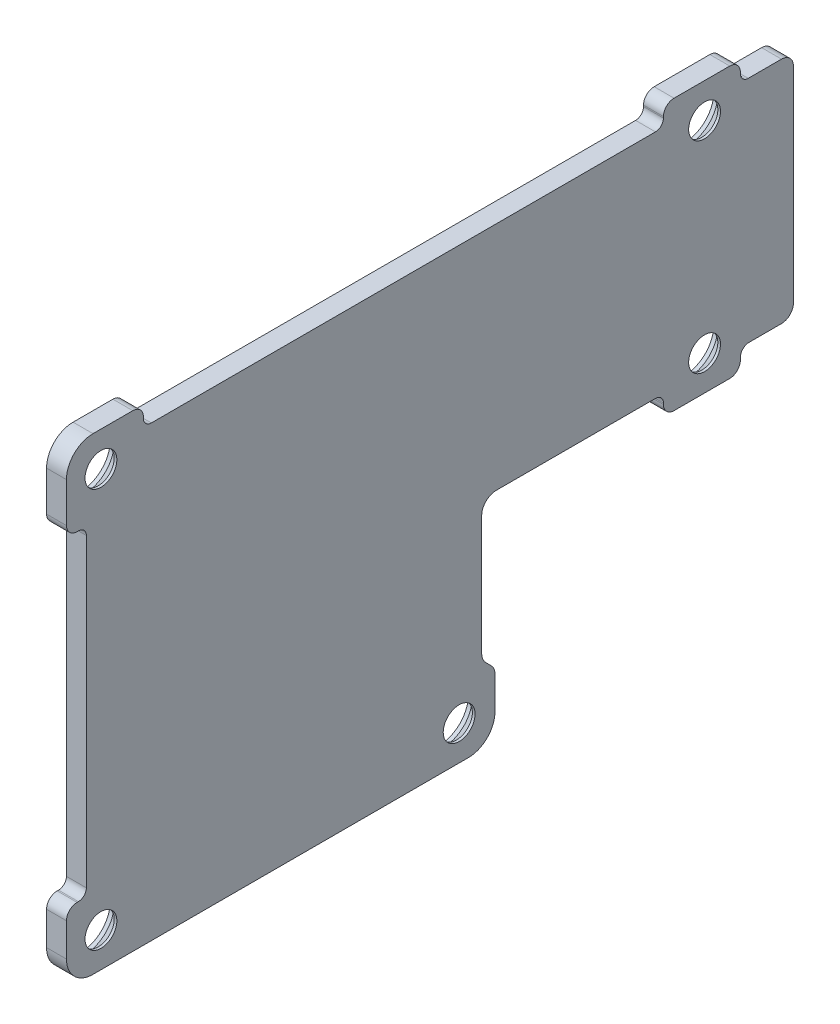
ISO-10303-21;
HEADER;
FILE_DESCRIPTION(('STEP AP214'),'2;1');
FILE_NAME('part.step','',(''),(''),'','','');
FILE_SCHEMA(('AUTOMOTIVE_DESIGN { 1 0 10303 214 1 1 1 1 }'));
ENDSEC;
DATA;
#1=APPLICATION_CONTEXT('core data for automotive mechanical design processes');
#2=APPLICATION_PROTOCOL_DEFINITION('international standard','automotive_design',2000,#1);
#3=PRODUCT_CONTEXT('',#1,'mechanical');
#4=PRODUCT('Part','Part','',(#3));
#5=PRODUCT_RELATED_PRODUCT_CATEGORY('part','',(#4));
#6=PRODUCT_DEFINITION_FORMATION('','',#4);
#7=PRODUCT_DEFINITION_CONTEXT('part definition',#1,'design');
#8=PRODUCT_DEFINITION('design','',#6,#7);
#9=PRODUCT_DEFINITION_SHAPE('','',#8);
#10=(LENGTH_UNIT() NAMED_UNIT(*) SI_UNIT(.MILLI.,.METRE.));
#11=(NAMED_UNIT(*) PLANE_ANGLE_UNIT() SI_UNIT($,.RADIAN.));
#12=(NAMED_UNIT(*) SI_UNIT($,.STERADIAN.) SOLID_ANGLE_UNIT());
#13=UNCERTAINTY_MEASURE_WITH_UNIT(LENGTH_MEASURE(1.E-05),#10,'distance_accuracy_value','');
#14=(GEOMETRIC_REPRESENTATION_CONTEXT(3) GLOBAL_UNCERTAINTY_ASSIGNED_CONTEXT((#13)) GLOBAL_UNIT_ASSIGNED_CONTEXT((#10,
#11,#12)) REPRESENTATION_CONTEXT('',''));
#15=CARTESIAN_POINT('',(0.,0.,0.));
#16=DIRECTION('',(0.,0.,1.));
#17=DIRECTION('',(1.,0.,0.));
#18=AXIS2_PLACEMENT_3D('',#15,#16,#17);
#19=CARTESIAN_POINT('',(-7.45,31.65,-13.2));
#20=DIRECTION('',(-1.,0.,0.));
#21=DIRECTION('',(0.,0.,1.));
#22=AXIS2_PLACEMENT_3D('',#19,#20,#21);
#23=CYLINDRICAL_SURFACE('',#22,2.2);
#24=CARTESIAN_POINT('',(-7.45,31.65,-13.2));
#25=DIRECTION('',(-1.,0.,0.));
#26=DIRECTION('',(0.,0.,1.));
#27=AXIS2_PLACEMENT_3D('',#24,#25,#26);
#28=CIRCLE('',#27,2.2);
#29=CARTESIAN_POINT('',(-7.45,31.65,-11.));
#30=VERTEX_POINT('',#29);
#31=EDGE_CURVE('E673',#30,#30,#28,.F.);
#32=ORIENTED_EDGE('',*,*,#31,.F.);
#33=EDGE_LOOP('',(#32));
#34=FACE_BOUND('',#33,.T.);
#35=CARTESIAN_POINT('',(-7.15000000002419,31.65,-13.2));
#36=DIRECTION('',(-1.,0.,0.));
#37=DIRECTION('',(0.,0.,-1.));
#38=AXIS2_PLACEMENT_3D('',#35,#36,#37);
#39=CIRCLE('',#38,2.20000000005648);
#40=CARTESIAN_POINT('',(-7.15000000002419,31.65,-15.4000000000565));
#41=VERTEX_POINT('',#40);
#42=EDGE_CURVE('E403',#41,#41,#39,.F.);
#43=ORIENTED_EDGE('',*,*,#42,.T.);
#44=EDGE_LOOP('',(#43));
#45=FACE_BOUND('',#44,.T.);
#46=ADVANCED_FACE('F17',(#34,#45),#23,.F.);
#47=CARTESIAN_POINT('',(-7.45,16.45,-13.2));
#48=DIRECTION('',(-1.,0.,0.));
#49=DIRECTION('',(0.,0.,1.));
#50=AXIS2_PLACEMENT_3D('',#47,#48,#49);
#51=CYLINDRICAL_SURFACE('',#50,2.2);
#52=CARTESIAN_POINT('',(-7.45,16.45,-13.2));
#53=DIRECTION('',(-1.,0.,0.));
#54=DIRECTION('',(0.,0.,1.));
#55=AXIS2_PLACEMENT_3D('',#52,#53,#54);
#56=CIRCLE('',#55,2.2);
#57=CARTESIAN_POINT('',(-7.45,16.45,-11.));
#58=VERTEX_POINT('',#57);
#59=EDGE_CURVE('E670',#58,#58,#56,.F.);
#60=ORIENTED_EDGE('',*,*,#59,.F.);
#61=EDGE_LOOP('',(#60));
#62=FACE_BOUND('',#61,.T.);
#63=CARTESIAN_POINT('',(-7.15000000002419,16.45,-13.2));
#64=DIRECTION('',(-1.,0.,0.));
#65=DIRECTION('',(0.,0.,-1.));
#66=AXIS2_PLACEMENT_3D('',#63,#64,#65);
#67=CIRCLE('',#66,2.20000000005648);
#68=CARTESIAN_POINT('',(-7.15000000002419,16.45,-15.4000000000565));
#69=VERTEX_POINT('',#68);
#70=EDGE_CURVE('E400',#69,#69,#67,.F.);
#71=ORIENTED_EDGE('',*,*,#70,.T.);
#72=EDGE_LOOP('',(#71));
#73=FACE_BOUND('',#72,.T.);
#74=ADVANCED_FACE('F1040',(#62,#73),#51,.F.);
#75=CARTESIAN_POINT('',(-7.45,1.55,5.3));
#76=DIRECTION('',(-1.,0.,0.));
#77=DIRECTION('',(0.,0.,1.));
#78=AXIS2_PLACEMENT_3D('',#75,#76,#77);
#79=CYLINDRICAL_SURFACE('',#78,2.2);
#80=CARTESIAN_POINT('',(-7.45,1.55,5.3));
#81=DIRECTION('',(-1.,0.,0.));
#82=DIRECTION('',(0.,0.,1.));
#83=AXIS2_PLACEMENT_3D('',#80,#81,#82);
#84=CIRCLE('',#83,2.2);
#85=CARTESIAN_POINT('',(-7.45,1.55,7.5));
#86=VERTEX_POINT('',#85);
#87=EDGE_CURVE('E405',#86,#86,#84,.F.);
#88=ORIENTED_EDGE('',*,*,#87,.F.);
#89=EDGE_LOOP('',(#88));
#90=FACE_BOUND('',#89,.T.);
#91=CARTESIAN_POINT('',(-7.14999999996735,1.55,5.3));
#92=DIRECTION('',(-1.,0.,0.));
#93=DIRECTION('',(0.,0.,-1.));
#94=AXIS2_PLACEMENT_3D('',#91,#92,#93);
#95=CIRCLE('',#94,2.2000000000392);
#96=CARTESIAN_POINT('',(-7.14999999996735,1.55,3.0999999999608));
#97=VERTEX_POINT('',#96);
#98=EDGE_CURVE('E397',#97,#97,#95,.F.);
#99=ORIENTED_EDGE('',*,*,#98,.T.);
#100=EDGE_LOOP('',(#99));
#101=FACE_BOUND('',#100,.T.);
#102=ADVANCED_FACE('F1032',(#90,#101),#79,.F.);
#103=CARTESIAN_POINT('',(-7.45,1.55,32.3));
#104=DIRECTION('',(-1.,0.,0.));
#105=DIRECTION('',(0.,0.,1.));
#106=AXIS2_PLACEMENT_3D('',#103,#104,#105);
#107=CYLINDRICAL_SURFACE('',#106,2.2);
#108=CARTESIAN_POINT('',(-7.45,1.55,32.3));
#109=DIRECTION('',(-1.,0.,0.));
#110=DIRECTION('',(0.,0.,1.));
#111=AXIS2_PLACEMENT_3D('',#108,#109,#110);
#112=CIRCLE('',#111,2.2);
#113=CARTESIAN_POINT('',(-7.45,1.55,34.5));
#114=VERTEX_POINT('',#113);
#115=EDGE_CURVE('E676',#114,#114,#112,.F.);
#116=ORIENTED_EDGE('',*,*,#115,.F.);
#117=EDGE_LOOP('',(#116));
#118=FACE_BOUND('',#117,.T.);
#119=CARTESIAN_POINT('',(-7.14999999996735,1.55,32.3));
#120=DIRECTION('',(-1.,0.,0.));
#121=DIRECTION('',(0.,0.,-1.));
#122=AXIS2_PLACEMENT_3D('',#119,#120,#121);
#123=CIRCLE('',#122,2.20000000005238);
#124=CARTESIAN_POINT('',(-7.14999999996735,1.55,30.0999999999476));
#125=VERTEX_POINT('',#124);
#126=EDGE_CURVE('E394',#125,#125,#123,.F.);
#127=ORIENTED_EDGE('',*,*,#126,.T.);
#128=EDGE_LOOP('',(#127));
#129=FACE_BOUND('',#128,.T.);
#130=ADVANCED_FACE('F1024',(#118,#129),#107,.F.);
#131=CARTESIAN_POINT('',(-7.45,31.65,32.3));
#132=DIRECTION('',(-1.,0.,0.));
#133=DIRECTION('',(0.,0.,1.));
#134=AXIS2_PLACEMENT_3D('',#131,#132,#133);
#135=CYLINDRICAL_SURFACE('',#134,2.2);
#136=CARTESIAN_POINT('',(-7.45,31.65,32.3));
#137=DIRECTION('',(-1.,0.,0.));
#138=DIRECTION('',(0.,0.,1.));
#139=AXIS2_PLACEMENT_3D('',#136,#137,#138);
#140=CIRCLE('',#139,2.2);
#141=CARTESIAN_POINT('',(-7.45,31.65,34.5));
#142=VERTEX_POINT('',#141);
#143=EDGE_CURVE('E549',#142,#142,#140,.F.);
#144=ORIENTED_EDGE('',*,*,#143,.F.);
#145=EDGE_LOOP('',(#144));
#146=FACE_BOUND('',#145,.T.);
#147=CARTESIAN_POINT('',(-7.14999999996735,31.65,32.3));
#148=DIRECTION('',(-1.,0.,0.));
#149=DIRECTION('',(0.,0.,-1.));
#150=AXIS2_PLACEMENT_3D('',#147,#148,#149);
#151=CIRCLE('',#150,2.20000000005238);
#152=CARTESIAN_POINT('',(-7.14999999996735,31.65,30.0999999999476));
#153=VERTEX_POINT('',#152);
#154=EDGE_CURVE('E391',#153,#153,#151,.F.);
#155=ORIENTED_EDGE('',*,*,#154,.T.);
#156=EDGE_LOOP('',(#155));
#157=FACE_BOUND('',#156,.T.);
#158=ADVANCED_FACE('F1017',(#146,#157),#135,.F.);
#159=CARTESIAN_POINT('',(-5.95,33.34992384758,29.1));
#160=DIRECTION('',(0.,0.,1.));
#161=DIRECTION('',(1.,0.,0.));
#162=AXIS2_PLACEMENT_3D('',#159,#160,#161);
#163=PLANE('',#162);
#164=DIRECTION('',(1.,0.,0.));
#165=VECTOR('',#164,1.);
#166=CARTESIAN_POINT('',(-5.95,33.34992384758,29.0999999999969));
#167=LINE('',#166,#165);
#168=CARTESIAN_POINT('',(-5.95,33.34992384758,29.0999999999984));
#169=VERTEX_POINT('',#168);
#170=CARTESIAN_POINT('',(-7.45,33.34992384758,29.0999999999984));
#171=VERTEX_POINT('',#170);
#172=EDGE_CURVE('E535',#169,#171,#167,.F.);
#173=ORIENTED_EDGE('',*,*,#172,.T.);
#174=DIRECTION('',(0.,1.,0.));
#175=VECTOR('',#174,1.);
#176=CARTESIAN_POINT('',(-7.45,0.,29.1));
#177=LINE('',#176,#175);
#178=CARTESIAN_POINT('',(-7.45,33.45,29.1));
#179=VERTEX_POINT('',#178);
#180=EDGE_CURVE('E327',#179,#171,#177,.F.);
#181=ORIENTED_EDGE('',*,*,#180,.F.);
#182=DIRECTION('',(-1.,0.,0.));
#183=VECTOR('',#182,1.);
#184=CARTESIAN_POINT('',(-3.9946,33.45,29.1));
#185=LINE('',#184,#183);
#186=CARTESIAN_POINT('',(-5.95,33.45,29.1));
#187=VERTEX_POINT('',#186);
#188=EDGE_CURVE('E541',#187,#179,#185,.T.);
#189=ORIENTED_EDGE('',*,*,#188,.F.);
#190=DIRECTION('',(0.,1.,0.));
#191=VECTOR('',#190,1.);
#192=CARTESIAN_POINT('',(-5.95,33.34992384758,29.1));
#193=LINE('',#192,#191);
#194=EDGE_CURVE('E381',#169,#187,#193,.T.);
#195=ORIENTED_EDGE('',*,*,#194,.F.);
#196=EDGE_LOOP('',(#173,#181,#189,#195));
#197=FACE_BOUND('',#196,.T.);
#198=ADVANCED_FACE('F578',(#197),#163,.F.);
#199=CARTESIAN_POINT('',(-5.95,34.25,-10.1));
#200=DIRECTION('',(0.,0.,-1.));
#201=DIRECTION('',(-1.,0.,0.));
#202=AXIS2_PLACEMENT_3D('',#199,#200,#201);
#203=PLANE('',#202);
#204=DIRECTION('',(1.,0.,0.));
#205=VECTOR('',#204,1.);
#206=CARTESIAN_POINT('',(-5.95,33.34992384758,-10.0999999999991));
#207=LINE('',#206,#205);
#208=CARTESIAN_POINT('',(-7.45,33.34992384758,-10.0999999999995));
#209=VERTEX_POINT('',#208);
#210=CARTESIAN_POINT('',(-5.95,33.34992384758,-10.0999999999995));
#211=VERTEX_POINT('',#210);
#212=EDGE_CURVE('E526',#209,#211,#207,.T.);
#213=ORIENTED_EDGE('',*,*,#212,.T.);
#214=DIRECTION('',(0.,1.,0.));
#215=VECTOR('',#214,1.);
#216=CARTESIAN_POINT('',(-5.95,34.25,-10.1));
#217=LINE('',#216,#215);
#218=CARTESIAN_POINT('',(-5.95,33.45,-10.1));
#219=VERTEX_POINT('',#218);
#220=EDGE_CURVE('E375',#219,#211,#217,.F.);
#221=ORIENTED_EDGE('',*,*,#220,.F.);
#222=DIRECTION('',(1.,0.,0.));
#223=VECTOR('',#222,1.);
#224=CARTESIAN_POINT('',(-9.4054,33.45,-10.1));
#225=LINE('',#224,#223);
#226=CARTESIAN_POINT('',(-7.45,33.45,-10.1));
#227=VERTEX_POINT('',#226);
#228=EDGE_CURVE('E379',#227,#219,#225,.T.);
#229=ORIENTED_EDGE('',*,*,#228,.F.);
#230=DIRECTION('',(0.,1.,0.));
#231=VECTOR('',#230,1.);
#232=CARTESIAN_POINT('',(-7.45,0.,-10.1));
#233=LINE('',#232,#231);
#234=EDGE_CURVE('E560',#209,#227,#233,.T.);
#235=ORIENTED_EDGE('',*,*,#234,.F.);
#236=EDGE_LOOP('',(#213,#221,#229,#235));
#237=FACE_BOUND('',#236,.T.);
#238=ADVANCED_FACE('F1002',(#237),#203,.F.);
#239=CARTESIAN_POINT('',(-5.95,33.34992384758,-15.9));
#240=DIRECTION('',(0.,0.,1.));
#241=DIRECTION('',(1.,0.,0.));
#242=AXIS2_PLACEMENT_3D('',#239,#240,#241);
#243=PLANE('',#242);
#244=DIRECTION('',(-1.,0.,0.));
#245=VECTOR('',#244,1.);
#246=CARTESIAN_POINT('',(-5.95,33.34992384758,-15.9000000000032));
#247=LINE('',#246,#245);
#248=CARTESIAN_POINT('',(-5.95,33.34992384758,-15.9000000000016));
#249=VERTEX_POINT('',#248);
#250=CARTESIAN_POINT('',(-7.45,33.3499238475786,-15.9000000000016));
#251=VERTEX_POINT('',#250);
#252=EDGE_CURVE('E510',#249,#251,#247,.T.);
#253=ORIENTED_EDGE('',*,*,#252,.T.);
#254=DIRECTION('',(0.,1.,0.));
#255=VECTOR('',#254,1.);
#256=CARTESIAN_POINT('',(-7.45,0.,-15.9));
#257=LINE('',#256,#255);
#258=CARTESIAN_POINT('',(-7.45,33.45,-15.9));
#259=VERTEX_POINT('',#258);
#260=EDGE_CURVE('E558',#259,#251,#257,.F.);
#261=ORIENTED_EDGE('',*,*,#260,.F.);
#262=DIRECTION('',(-1.,0.,0.));
#263=VECTOR('',#262,1.);
#264=CARTESIAN_POINT('',(-3.9946,33.45,-15.9));
#265=LINE('',#264,#263);
#266=CARTESIAN_POINT('',(-5.95,33.45,-15.9));
#267=VERTEX_POINT('',#266);
#268=EDGE_CURVE('E520',#267,#259,#265,.T.);
#269=ORIENTED_EDGE('',*,*,#268,.F.);
#270=DIRECTION('',(0.,1.,0.));
#271=VECTOR('',#270,1.);
#272=CARTESIAN_POINT('',(-5.95,33.34992384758,-15.9));
#273=LINE('',#272,#271);
#274=EDGE_CURVE('E360',#249,#267,#273,.T.);
#275=ORIENTED_EDGE('',*,*,#274,.F.);
#276=EDGE_LOOP('',(#253,#261,#269,#275));
#277=FACE_BOUND('',#276,.T.);
#278=ADVANCED_FACE('F994',(#277),#243,.F.);
#279=CARTESIAN_POINT('',(-5.95,13.85,-15.9));
#280=DIRECTION('',(0.,0.,1.));
#281=DIRECTION('',(1.,0.,0.));
#282=AXIS2_PLACEMENT_3D('',#279,#280,#281);
#283=PLANE('',#282);
#284=DIRECTION('',(-1.,0.,0.));
#285=VECTOR('',#284,1.);
#286=CARTESIAN_POINT('',(-5.95,14.75007615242,-15.8999999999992));
#287=LINE('',#286,#285);
#288=CARTESIAN_POINT('',(-7.45,14.75007615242,-15.8999999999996));
#289=VERTEX_POINT('',#288);
#290=CARTESIAN_POINT('',(-5.95,14.75007615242,-15.8999999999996));
#291=VERTEX_POINT('',#290);
#292=EDGE_CURVE('E642',#289,#291,#287,.F.);
#293=ORIENTED_EDGE('',*,*,#292,.T.);
#294=DIRECTION('',(0.,1.,0.));
#295=VECTOR('',#294,1.);
#296=CARTESIAN_POINT('',(-5.95,13.85,-15.9));
#297=LINE('',#296,#295);
#298=CARTESIAN_POINT('',(-5.95,14.65,-15.9));
#299=VERTEX_POINT('',#298);
#300=EDGE_CURVE('E354',#299,#291,#297,.T.);
#301=ORIENTED_EDGE('',*,*,#300,.F.);
#302=DIRECTION('',(-1.,0.,0.));
#303=VECTOR('',#302,1.);
#304=CARTESIAN_POINT('',(-3.9946,14.65,-15.9));
#305=LINE('',#304,#303);
#306=CARTESIAN_POINT('',(-7.45,14.65,-15.9));
#307=VERTEX_POINT('',#306);
#308=EDGE_CURVE('E634',#307,#299,#305,.F.);
#309=ORIENTED_EDGE('',*,*,#308,.F.);
#310=DIRECTION('',(0.,1.,0.));
#311=VECTOR('',#310,1.);
#312=CARTESIAN_POINT('',(-7.45,0.,-15.9));
#313=LINE('',#312,#311);
#314=EDGE_CURVE('E556',#289,#307,#313,.F.);
#315=ORIENTED_EDGE('',*,*,#314,.F.);
#316=EDGE_LOOP('',(#293,#301,#309,#315));
#317=FACE_BOUND('',#316,.T.);
#318=ADVANCED_FACE('F986',(#317),#283,.F.);
#319=CARTESIAN_POINT('',(-5.95,14.75007615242,-10.1));
#320=DIRECTION('',(0.,0.,-1.));
#321=DIRECTION('',(-1.,0.,0.));
#322=AXIS2_PLACEMENT_3D('',#319,#320,#321);
#323=PLANE('',#322);
#324=DIRECTION('',(-1.,0.,0.));
#325=VECTOR('',#324,1.);
#326=CARTESIAN_POINT('',(-5.95,14.75007615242,-10.100000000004));
#327=LINE('',#326,#325);
#328=CARTESIAN_POINT('',(-5.95,14.75007615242,-10.100000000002));
#329=VERTEX_POINT('',#328);
#330=CARTESIAN_POINT('',(-7.45,14.75007615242,-10.100000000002));
#331=VERTEX_POINT('',#330);
#332=EDGE_CURVE('E626',#329,#331,#327,.T.);
#333=ORIENTED_EDGE('',*,*,#332,.T.);
#334=DIRECTION('',(0.,1.,0.));
#335=VECTOR('',#334,1.);
#336=CARTESIAN_POINT('',(-7.45,0.,-10.1));
#337=LINE('',#336,#335);
#338=CARTESIAN_POINT('',(-7.45,14.65,-10.1));
#339=VERTEX_POINT('',#338);
#340=EDGE_CURVE('E554',#339,#331,#337,.T.);
#341=ORIENTED_EDGE('',*,*,#340,.F.);
#342=DIRECTION('',(-1.,0.,0.));
#343=VECTOR('',#342,1.);
#344=CARTESIAN_POINT('',(-3.9946,14.65,-10.1));
#345=LINE('',#344,#343);
#346=CARTESIAN_POINT('',(-5.95,14.65,-10.1));
#347=VERTEX_POINT('',#346);
#348=EDGE_CURVE('E630',#347,#339,#345,.T.);
#349=ORIENTED_EDGE('',*,*,#348,.F.);
#350=DIRECTION('',(0.,1.,0.));
#351=VECTOR('',#350,1.);
#352=CARTESIAN_POINT('',(-5.95,14.75007615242,-10.1));
#353=LINE('',#352,#351);
#354=EDGE_CURVE('E306',#329,#347,#353,.F.);
#355=ORIENTED_EDGE('',*,*,#354,.F.);
#356=EDGE_LOOP('',(#333,#341,#349,#355));
#357=FACE_BOUND('',#356,.T.);
#358=ADVANCED_FACE('F979',(#357),#323,.F.);
#359=CARTESIAN_POINT('',(-5.95,4.072182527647,2.863603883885));
#360=DIRECTION('',(0.,-0.707106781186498,0.707106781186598));
#361=DIRECTION('',(0.,-0.707106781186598,-0.707106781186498));
#362=AXIS2_PLACEMENT_3D('',#359,#360,#361);
#363=PLANE('',#362);
#364=DIRECTION('',(0.,-0.707106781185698,-0.707106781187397));
#365=VECTOR('',#364,1.);
#366=CARTESIAN_POINT('',(-7.45,4.486396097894,3.277817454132));
#367=LINE('',#366,#365);
#368=CARTESIAN_POINT('',(-7.45,4.48639609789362,3.27781745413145));
#369=VERTEX_POINT('',#368);
#370=CARTESIAN_POINT('',(-7.45,4.07218252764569,2.86360388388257));
#371=VERTEX_POINT('',#370);
#372=EDGE_CURVE('E552',#369,#371,#367,.T.);
#373=ORIENTED_EDGE('',*,*,#372,.F.);
#374=DIRECTION('',(-1.,0.,0.));
#375=VECTOR('',#374,1.);
#376=CARTESIAN_POINT('',(-5.95,4.48639609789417,3.27781745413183));
#377=LINE('',#376,#375);
#378=CARTESIAN_POINT('',(-5.95,4.48639609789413,3.27781745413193));
#379=VERTEX_POINT('',#378);
#380=EDGE_CURVE('E301',#369,#379,#377,.F.);
#381=ORIENTED_EDGE('',*,*,#380,.T.);
#382=DIRECTION('',(0.,-0.707106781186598,-0.707106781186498));
#383=VECTOR('',#382,1.);
#384=CARTESIAN_POINT('',(-5.95,4.072182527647,2.863603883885));
#385=LINE('',#384,#383);
#386=CARTESIAN_POINT('',(-5.95,4.07218252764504,2.86360388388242));
#387=VERTEX_POINT('',#386);
#388=EDGE_CURVE('E295',#387,#379,#385,.F.);
#389=ORIENTED_EDGE('',*,*,#388,.F.);
#390=DIRECTION('',(-1.,0.,0.));
#391=VECTOR('',#390,1.);
#392=CARTESIAN_POINT('',(-5.95,4.07218252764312,2.86360388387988));
#393=LINE('',#392,#391);
#394=EDGE_CURVE('E298',#371,#387,#393,.F.);
#395=ORIENTED_EDGE('',*,*,#394,.F.);
#396=EDGE_LOOP('',(#373,#381,#389,#395));
#397=FACE_BOUND('',#396,.T.);
#398=ADVANCED_FACE('F297',(#397),#363,.F.);
#399=CARTESIAN_POINT('',(-5.95,3.435786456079,3.499999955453));
#400=DIRECTION('',(-1.,0.,0.));
#401=DIRECTION('',(0.,0.,1.));
#402=AXIS2_PLACEMENT_3D('',#399,#400,#401);
#403=CYLINDRICAL_SURFACE('',#402,0.8999999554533);
#404=ORIENTED_EDGE('',*,*,#394,.T.);
#405=CARTESIAN_POINT('',(-5.95,3.435786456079,3.499999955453));
#406=DIRECTION('',(-1.,0.,0.));
#407=DIRECTION('',(0.,0.,1.));
#408=AXIS2_PLACEMENT_3D('',#405,#406,#407);
#409=CIRCLE('',#408,0.8999999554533);
#410=CARTESIAN_POINT('',(-5.95,3.43578645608,2.6));
#411=VERTEX_POINT('',#410);
#412=EDGE_CURVE('E20',#387,#411,#409,.T.);
#413=ORIENTED_EDGE('',*,*,#412,.T.);
#414=DIRECTION('',(1.,0.,0.));
#415=VECTOR('',#414,1.);
#416=CARTESIAN_POINT('',(-5.95,3.435786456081,2.6));
#417=LINE('',#416,#415);
#418=CARTESIAN_POINT('',(-7.45,3.43578645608,2.6));
#419=VERTEX_POINT('',#418);
#420=EDGE_CURVE('E343',#411,#419,#417,.F.);
#421=ORIENTED_EDGE('',*,*,#420,.T.);
#422=CARTESIAN_POINT('',(-7.45,3.435786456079,3.499999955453));
#423=DIRECTION('',(-1.,0.,0.));
#424=DIRECTION('',(0.,0.,1.));
#425=AXIS2_PLACEMENT_3D('',#422,#423,#424);
#426=CIRCLE('',#425,0.8999999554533);
#427=EDGE_CURVE('E313',#371,#419,#426,.T.);
#428=ORIENTED_EDGE('',*,*,#427,.F.);
#429=EDGE_LOOP('',(#404,#413,#421,#428));
#430=FACE_BOUND('',#429,.T.);
#431=ADVANCED_FACE('F310',(#430),#403,.T.);
#432=CARTESIAN_POINT('',(-5.95,4.25,33.99992384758));
#433=DIRECTION('',(0.,-1.,0.));
#434=DIRECTION('',(0.,0.,-1.));
#435=AXIS2_PLACEMENT_3D('',#432,#433,#434);
#436=PLANE('',#435);
#437=DIRECTION('',(1.,0.,0.));
#438=VECTOR('',#437,1.);
#439=CARTESIAN_POINT('',(-5.95,4.24999999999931,33.99992384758));
#440=LINE('',#439,#438);
#441=CARTESIAN_POINT('',(-5.95,4.24999999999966,33.99992384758));
#442=VERTEX_POINT('',#441);
#443=CARTESIAN_POINT('',(-7.45,4.24999999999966,33.99992384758));
#444=VERTEX_POINT('',#443);
#445=EDGE_CURVE('E611',#442,#444,#440,.F.);
#446=ORIENTED_EDGE('',*,*,#445,.T.);
#447=DIRECTION('',(0.,0.,1.));
#448=VECTOR('',#447,1.);
#449=CARTESIAN_POINT('',(-7.45,4.25,35.));
#450=LINE('',#449,#448);
#451=CARTESIAN_POINT('',(-7.45,4.25,34.1));
#452=VERTEX_POINT('',#451);
#453=EDGE_CURVE('E550',#452,#444,#450,.F.);
#454=ORIENTED_EDGE('',*,*,#453,.F.);
#455=DIRECTION('',(-1.,0.,0.));
#456=VECTOR('',#455,1.);
#457=CARTESIAN_POINT('',(-3.9946,4.25,34.1));
#458=LINE('',#457,#456);
#459=CARTESIAN_POINT('',(-5.95,4.25,34.1));
#460=VERTEX_POINT('',#459);
#461=EDGE_CURVE('E615',#460,#452,#458,.T.);
#462=ORIENTED_EDGE('',*,*,#461,.F.);
#463=DIRECTION('',(0.,0.,-1.));
#464=VECTOR('',#463,1.);
#465=CARTESIAN_POINT('',(-5.95,4.25,33.99992384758));
#466=LINE('',#465,#464);
#467=EDGE_CURVE('E321',#442,#460,#466,.F.);
#468=ORIENTED_EDGE('',*,*,#467,.F.);
#469=EDGE_LOOP('',(#446,#454,#462,#468));
#470=FACE_BOUND('',#469,.T.);
#471=ADVANCED_FACE('F960',(#470),#436,.F.);
#472=CARTESIAN_POINT('',(-5.95,28.45,35.1));
#473=DIRECTION('',(0.,1.,0.));
#474=DIRECTION('',(0.,0.,1.));
#475=AXIS2_PLACEMENT_3D('',#472,#473,#474);
#476=PLANE('',#475);
#477=DIRECTION('',(1.,0.,0.));
#478=VECTOR('',#477,1.);
#479=CARTESIAN_POINT('',(-5.95,28.4499999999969,33.99992384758));
#480=LINE('',#479,#478);
#481=CARTESIAN_POINT('',(-7.45,28.4499999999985,33.99992384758));
#482=VERTEX_POINT('',#481);
#483=CARTESIAN_POINT('',(-5.95,28.4499999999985,33.99992384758));
#484=VERTEX_POINT('',#483);
#485=EDGE_CURVE('E603',#482,#484,#480,.T.);
#486=ORIENTED_EDGE('',*,*,#485,.T.);
#487=DIRECTION('',(0.,0.,1.));
#488=VECTOR('',#487,1.);
#489=CARTESIAN_POINT('',(-5.95,28.45,35.1));
#490=LINE('',#489,#488);
#491=CARTESIAN_POINT('',(-5.95,28.45,34.1));
#492=VERTEX_POINT('',#491);
#493=EDGE_CURVE('E322',#492,#484,#490,.F.);
#494=ORIENTED_EDGE('',*,*,#493,.F.);
#495=DIRECTION('',(1.,0.,0.));
#496=VECTOR('',#495,1.);
#497=CARTESIAN_POINT('',(-9.4054,28.45,34.1));
#498=LINE('',#497,#496);
#499=CARTESIAN_POINT('',(-7.45,28.45,34.1));
#500=VERTEX_POINT('',#499);
#501=EDGE_CURVE('E546',#500,#492,#498,.T.);
#502=ORIENTED_EDGE('',*,*,#501,.F.);
#503=DIRECTION('',(0.,0.,1.));
#504=VECTOR('',#503,1.);
#505=CARTESIAN_POINT('',(-7.45,28.45,35.));
#506=LINE('',#505,#504);
#507=EDGE_CURVE('E547',#482,#500,#506,.T.);
#508=ORIENTED_EDGE('',*,*,#507,.F.);
#509=EDGE_LOOP('',(#486,#494,#502,#508));
#510=FACE_BOUND('',#509,.T.);
#511=ADVANCED_FACE('F650',(#510),#476,.F.);
#512=CARTESIAN_POINT('',(-7.45,0.,35.));
#513=DIRECTION('',(-1.,0.,0.));
#514=DIRECTION('',(0.,0.,1.));
#515=AXIS2_PLACEMENT_3D('',#512,#513,#514);
#516=PLANE('',#515);
#517=ORIENTED_EDGE('',*,*,#87,.T.);
#518=EDGE_LOOP('',(#517));
#519=FACE_BOUND('',#518,.T.);
#520=ORIENTED_EDGE('',*,*,#59,.T.);
#521=EDGE_LOOP('',(#520));
#522=FACE_BOUND('',#521,.T.);
#523=ORIENTED_EDGE('',*,*,#31,.T.);
#524=EDGE_LOOP('',(#523));
#525=FACE_BOUND('',#524,.T.);
#526=ORIENTED_EDGE('',*,*,#115,.T.);
#527=EDGE_LOOP('',(#526));
#528=FACE_BOUND('',#527,.T.);
#529=ORIENTED_EDGE('',*,*,#143,.T.);
#530=EDGE_LOOP('',(#529));
#531=FACE_BOUND('',#530,.T.);
#532=DIRECTION('',(0.,1.,0.));
#533=VECTOR('',#532,1.);
#534=CARTESIAN_POINT('',(-7.45,-1.05,34.9));
#535=LINE('',#534,#533);
#536=CARTESIAN_POINT('',(-7.45,32.25,34.9));
#537=VERTEX_POINT('',#536);
#538=CARTESIAN_POINT('',(-7.45,29.25,34.9));
#539=VERTEX_POINT('',#538);
#540=EDGE_CURVE('E544',#537,#539,#535,.F.);
#541=ORIENTED_EDGE('',*,*,#540,.F.);
#542=CARTESIAN_POINT('',(-7.45,32.25,32.9));
#543=DIRECTION('',(1.,0.,0.));
#544=DIRECTION('',(0.,0.,-1.));
#545=AXIS2_PLACEMENT_3D('',#542,#543,#544);
#546=CIRCLE('',#545,2.);
#547=CARTESIAN_POINT('',(-7.45,34.25,32.9));
#548=VERTEX_POINT('',#547);
#549=EDGE_CURVE('E390',#548,#537,#546,.T.);
#550=ORIENTED_EDGE('',*,*,#549,.F.);
#551=DIRECTION('',(0.,0.,1.));
#552=VECTOR('',#551,1.);
#553=CARTESIAN_POINT('',(-7.45,34.25,34.9));
#554=LINE('',#553,#552);
#555=CARTESIAN_POINT('',(-7.45,34.25,29.9));
#556=VERTEX_POINT('',#555);
#557=EDGE_CURVE('E387',#556,#548,#554,.T.);
#558=ORIENTED_EDGE('',*,*,#557,.F.);
#559=CARTESIAN_POINT('',(-7.45,33.45,29.9));
#560=DIRECTION('',(-1.,0.,0.));
#561=DIRECTION('',(0.,0.,1.));
#562=AXIS2_PLACEMENT_3D('',#559,#560,#561);
#563=CIRCLE('',#562,0.8);
#564=EDGE_CURVE('E538',#179,#556,#563,.F.);
#565=ORIENTED_EDGE('',*,*,#564,.F.);
#566=ORIENTED_EDGE('',*,*,#180,.T.);
#567=CARTESIAN_POINT('',(-7.45,33.34989598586,28.50010401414));
#568=DIRECTION('',(1.,0.,0.));
#569=DIRECTION('',(0.,0.,-1.));
#570=AXIS2_PLACEMENT_3D('',#567,#568,#569);
#571=CIRCLE('',#570,0.5998959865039);
#572=CARTESIAN_POINT('',(-7.45,32.7500000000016,28.50007615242));
#573=VERTEX_POINT('',#572);
#574=EDGE_CURVE('E534',#171,#573,#571,.T.);
#575=ORIENTED_EDGE('',*,*,#574,.T.);
#576=DIRECTION('',(0.,0.,-1.));
#577=VECTOR('',#576,1.);
#578=CARTESIAN_POINT('',(-7.45,32.75,-9.500076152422));
#579=LINE('',#578,#577);
#580=CARTESIAN_POINT('',(-7.45,32.750000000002,-9.500076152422));
#581=VERTEX_POINT('',#580);
#582=EDGE_CURVE('E382',#573,#581,#579,.T.);
#583=ORIENTED_EDGE('',*,*,#582,.T.);
#584=CARTESIAN_POINT('',(-7.45,33.34989598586,-9.500104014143));
#585=DIRECTION('',(1.,0.,0.));
#586=DIRECTION('',(0.,0.,-1.));
#587=AXIS2_PLACEMENT_3D('',#584,#585,#586);
#588=CIRCLE('',#587,0.5998959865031);
#589=EDGE_CURVE('E529',#581,#209,#588,.T.);
#590=ORIENTED_EDGE('',*,*,#589,.T.);
#591=ORIENTED_EDGE('',*,*,#234,.T.);
#592=CARTESIAN_POINT('',(-7.45,33.45,-10.9));
#593=DIRECTION('',(1.,0.,0.));
#594=DIRECTION('',(0.,0.,-1.));
#595=AXIS2_PLACEMENT_3D('',#592,#593,#594);
#596=CIRCLE('',#595,0.8);
#597=CARTESIAN_POINT('',(-7.45,34.25,-10.9));
#598=VERTEX_POINT('',#597);
#599=EDGE_CURVE('E525',#598,#227,#596,.T.);
#600=ORIENTED_EDGE('',*,*,#599,.F.);
#601=DIRECTION('',(0.,0.,1.));
#602=VECTOR('',#601,1.);
#603=CARTESIAN_POINT('',(-7.45,34.25,34.9));
#604=LINE('',#603,#602);
#605=CARTESIAN_POINT('',(-7.45,34.25,-15.1));
#606=VERTEX_POINT('',#605);
#607=EDGE_CURVE('E376',#606,#598,#604,.T.);
#608=ORIENTED_EDGE('',*,*,#607,.F.);
#609=CARTESIAN_POINT('',(-7.45,33.45,-15.1));
#610=DIRECTION('',(-1.,0.,0.));
#611=DIRECTION('',(0.,0.,1.));
#612=AXIS2_PLACEMENT_3D('',#609,#610,#611);
#613=CIRCLE('',#612,0.8);
#614=EDGE_CURVE('E517',#259,#606,#613,.F.);
#615=ORIENTED_EDGE('',*,*,#614,.F.);
#616=ORIENTED_EDGE('',*,*,#260,.T.);
#617=CARTESIAN_POINT('',(-7.45,33.3499238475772,-15.9000000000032));
#618=CARTESIAN_POINT('',(-7.45,33.3159555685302,-15.9000041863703));
#619=CARTESIAN_POINT('',(-7.45,33.2819991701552,-15.9028920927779));
#620=CARTESIAN_POINT('',(-7.45,33.215043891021,-15.9142524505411));
#621=CARTESIAN_POINT('',(-7.45,33.1820447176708,-15.922723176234));
#622=CARTESIAN_POINT('',(-7.45,33.1178724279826,-15.9450815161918));
#623=CARTESIAN_POINT('',(-7.45,33.0867018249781,-15.9589763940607));
#624=CARTESIAN_POINT('',(-7.45,33.0272788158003,-15.9919937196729));
#625=CARTESIAN_POINT('',(-7.45,32.9990250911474,-16.0111137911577));
#626=CARTESIAN_POINT('',(-7.45,32.9467377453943,-16.0533806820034));
#627=CARTESIAN_POINT('',(-7.45,32.92262618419,-16.076431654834));
#628=CARTESIAN_POINT('',(-7.45,32.8784806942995,-16.1261775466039));
#629=CARTESIAN_POINT('',(-7.45,32.8584482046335,-16.1528737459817));
#630=CARTESIAN_POINT('',(-7.45,32.8228242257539,-16.2097822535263));
#631=CARTESIAN_POINT('',(-7.45,32.8073228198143,-16.2400509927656));
#632=CARTESIAN_POINT('',(-7.45,32.7816559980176,-16.3027537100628));
#633=CARTESIAN_POINT('',(-7.45,32.7714867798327,-16.3351861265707));
#634=CARTESIAN_POINT('',(-7.45,32.7594678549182,-16.389139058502));
#635=CARTESIAN_POINT('',(-7.45,32.7559347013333,-16.4102979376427));
#636=CARTESIAN_POINT('',(-7.45,32.7512027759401,-16.4528443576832));
#637=CARTESIAN_POINT('',(-7.45,32.7500007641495,-16.4742315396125));
#638=CARTESIAN_POINT('',(-7.45,32.7499999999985,-16.49563512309));
#639=B_SPLINE_CURVE_WITH_KNOTS('',3,(#617,#618,#619,#620,#621,#622,#623,#624,#625,#626,#627,
#628,#629,#630,#631,#632,#633,#634,#635,#636,#637,#638),.UNSPECIFIED.,.F.,.F.,(4,2,2,2,2,2,2,2,
2,2,4),(0.,0.101769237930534,0.203507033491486,0.305381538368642,0.407209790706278,
0.506839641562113,0.606504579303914,0.708033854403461,0.809490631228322,0.873728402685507,
0.93787682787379),.UNSPECIFIED.);
#640=CARTESIAN_POINT('',(-7.45,32.7499999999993,-16.49563512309));
#641=VERTEX_POINT('',#640);
#642=EDGE_CURVE('E516',#251,#641,#639,.T.);
#643=ORIENTED_EDGE('',*,*,#642,.T.);
#644=DIRECTION('',(0.,0.,-1.));
#645=VECTOR('',#644,1.);
#646=CARTESIAN_POINT('',(-7.45,32.75,-19.9));
#647=LINE('',#646,#645);
#648=CARTESIAN_POINT('',(-7.45,32.75,-19.));
#649=VERTEX_POINT('',#648);
#650=EDGE_CURVE('E369',#641,#649,#647,.T.);
#651=ORIENTED_EDGE('',*,*,#650,.T.);
#652=CARTESIAN_POINT('',(-7.45,31.85,-19.));
#653=DIRECTION('',(1.,0.,0.));
#654=DIRECTION('',(0.,0.,-1.));
#655=AXIS2_PLACEMENT_3D('',#652,#653,#654);
#656=CIRCLE('',#655,0.9);
#657=CARTESIAN_POINT('',(-7.45,31.85,-19.9));
#658=VERTEX_POINT('',#657);
#659=EDGE_CURVE('E372',#658,#649,#656,.T.);
#660=ORIENTED_EDGE('',*,*,#659,.F.);
#661=DIRECTION('',(0.,1.,0.));
#662=VECTOR('',#661,1.);
#663=CARTESIAN_POINT('',(-7.45,34.25,-19.9));
#664=LINE('',#663,#662);
#665=CARTESIAN_POINT('',(-7.45,16.38198324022,-19.9));
#666=VERTEX_POINT('',#665);
#667=EDGE_CURVE('E365',#666,#658,#664,.T.);
#668=ORIENTED_EDGE('',*,*,#667,.F.);
#669=CARTESIAN_POINT('',(-7.45,16.38198324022,-19.));
#670=DIRECTION('',(-1.,0.,0.));
#671=DIRECTION('',(0.,0.,1.));
#672=AXIS2_PLACEMENT_3D('',#669,#670,#671);
#673=CIRCLE('',#672,0.9);
#674=CARTESIAN_POINT('',(-7.45,15.48198324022,-19.));
#675=VERTEX_POINT('',#674);
#676=EDGE_CURVE('E643',#675,#666,#673,.F.);
#677=ORIENTED_EDGE('',*,*,#676,.F.);
#678=DIRECTION('',(0.,0.,1.));
#679=VECTOR('',#678,1.);
#680=CARTESIAN_POINT('',(-7.45,15.48198324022,-16.49563512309));
#681=LINE('',#680,#679);
#682=CARTESIAN_POINT('',(-7.45,15.4819832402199,-16.49563512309));
#683=VERTEX_POINT('',#682);
#684=EDGE_CURVE('E361',#675,#683,#681,.T.);
#685=ORIENTED_EDGE('',*,*,#684,.T.);
#686=CARTESIAN_POINT('',(-7.45,15.4819832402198,-16.49563512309));
#687=CARTESIAN_POINT('',(-7.45,15.4820222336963,-16.46904236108));
#688=CARTESIAN_POINT('',(-7.45,15.4792961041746,-16.4426185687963));
#689=CARTESIAN_POINT('',(-7.45,15.4693011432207,-16.3910210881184));
#690=CARTESIAN_POINT('',(-7.45,15.462099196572,-16.3658347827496));
#691=CARTESIAN_POINT('',(-7.45,15.4408100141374,-16.3078981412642));
#692=CARTESIAN_POINT('',(-7.45,15.4251708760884,-16.2757308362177));
#693=CARTESIAN_POINT('',(-7.45,15.3981043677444,-16.229502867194));
#694=CARTESIAN_POINT('',(-7.45,15.3884229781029,-16.2143597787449));
#695=CARTESIAN_POINT('',(-7.45,15.3680385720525,-16.1847751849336));
#696=CARTESIAN_POINT('',(-7.45,15.3573355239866,-16.1703337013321));
#697=CARTESIAN_POINT('',(-7.45,15.3226129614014,-16.1265710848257));
#698=CARTESIAN_POINT('',(-7.45,15.296981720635,-16.0984978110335));
#699=CARTESIAN_POINT('',(-7.45,15.2417648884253,-16.0469614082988));
#700=CARTESIAN_POINT('',(-7.45,15.2122143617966,-16.0234614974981));
#701=CARTESIAN_POINT('',(-7.45,15.1640442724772,-15.991926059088));
#702=CARTESIAN_POINT('',(-7.45,15.1467795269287,-15.9817995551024));
#703=CARTESIAN_POINT('',(-7.45,15.1112557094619,-15.963473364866));
#704=CARTESIAN_POINT('',(-7.45,15.09299715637,-15.9552726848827));
#705=CARTESIAN_POINT('',(-7.45,15.0555372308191,-15.9408711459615));
#706=CARTESIAN_POINT('',(-7.45,15.0363291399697,-15.9346879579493));
#707=CARTESIAN_POINT('',(-7.45,14.9974231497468,-15.9241181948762));
#708=CARTESIAN_POINT('',(-7.45,14.977724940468,-15.9197327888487));
#709=CARTESIAN_POINT('',(-7.45,14.923415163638,-15.9097940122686));
#710=CARTESIAN_POINT('',(-7.45,14.8885360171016,-15.9057709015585));
#711=CARTESIAN_POINT('',(-7.45,14.819077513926,-15.900914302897));
#712=CARTESIAN_POINT('',(-7.45,14.7845018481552,-15.9000325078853));
#713=CARTESIAN_POINT('',(-7.45,14.75007615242,-15.8999999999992));
#714=B_SPLINE_CURVE_WITH_KNOTS('',3,(#686,#687,#688,#689,#690,#691,#692,#693,#694,#695,#696,
#697,#698,#699,#700,#701,#702,#703,#704,#705,#706,#707,#708,#709,#710,#711,#712,#713),
.UNSPECIFIED.,.F.,.F.,(4,2,2,2,2,2,2,2,2,2,2,2,2,4),(0.,0.0793813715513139,0.157604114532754,
0.264294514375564,0.318184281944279,0.372075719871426,0.485695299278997,0.598359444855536,
0.658308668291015,0.718226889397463,0.77865665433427,0.839125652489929,0.94426329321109,
1.0477769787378),.UNSPECIFIED.);
#715=EDGE_CURVE('E635',#683,#289,#714,.T.);
#716=ORIENTED_EDGE('',*,*,#715,.T.);
#717=ORIENTED_EDGE('',*,*,#314,.T.);
#718=CARTESIAN_POINT('',(-7.45,14.65,-15.1));
#719=DIRECTION('',(-1.,0.,0.));
#720=DIRECTION('',(0.,0.,1.));
#721=AXIS2_PLACEMENT_3D('',#718,#719,#720);
#722=CIRCLE('',#721,0.8);
#723=CARTESIAN_POINT('',(-7.45,13.85,-15.1));
#724=VERTEX_POINT('',#723);
#725=EDGE_CURVE('E631',#724,#307,#722,.F.);
#726=ORIENTED_EDGE('',*,*,#725,.F.);
#727=DIRECTION('',(0.,0.,1.));
#728=VECTOR('',#727,1.);
#729=CARTESIAN_POINT('',(-7.45,13.85,-10.1));
#730=LINE('',#729,#728);
#731=CARTESIAN_POINT('',(-7.45,13.85,-10.9));
#732=VERTEX_POINT('',#731);
#733=EDGE_CURVE('E355',#724,#732,#730,.T.);
#734=ORIENTED_EDGE('',*,*,#733,.T.);
#735=CARTESIAN_POINT('',(-7.45,14.65,-10.9));
#736=DIRECTION('',(-1.,0.,0.));
#737=DIRECTION('',(0.,0.,1.));
#738=AXIS2_PLACEMENT_3D('',#735,#736,#737);
#739=CIRCLE('',#738,0.8);
#740=EDGE_CURVE('E627',#339,#732,#739,.F.);
#741=ORIENTED_EDGE('',*,*,#740,.F.);
#742=ORIENTED_EDGE('',*,*,#340,.T.);
#743=CARTESIAN_POINT('',(-7.45,14.75010401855,-9.500104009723));
#744=DIRECTION('',(-1.,0.,0.));
#745=DIRECTION('',(0.,0.,1.));
#746=AXIS2_PLACEMENT_3D('',#743,#744,#745);
#747=CIRCLE('',#746,0.5998959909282);
#748=CARTESIAN_POINT('',(-7.45,15.3500000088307,-9.500076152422));
#749=VERTEX_POINT('',#748);
#750=EDGE_CURVE('E624',#331,#749,#747,.F.);
#751=ORIENTED_EDGE('',*,*,#750,.T.);
#752=DIRECTION('',(0.,0.,1.));
#753=VECTOR('',#752,1.);
#754=CARTESIAN_POINT('',(-7.45,15.35000000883,2.499999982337));
#755=LINE('',#754,#753);
#756=CARTESIAN_POINT('',(-7.45,15.3500000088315,2.499999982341));
#757=VERTEX_POINT('',#756);
#758=EDGE_CURVE('E349',#749,#757,#755,.T.);
#759=ORIENTED_EDGE('',*,*,#758,.T.);
#760=CARTESIAN_POINT('',(-7.45,14.24999999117,2.499999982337));
#761=DIRECTION('',(-1.,0.,0.));
#762=DIRECTION('',(0.,0.,1.));
#763=AXIS2_PLACEMENT_3D('',#760,#761,#762);
#764=CIRCLE('',#763,1.100000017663);
#765=CARTESIAN_POINT('',(-7.45,14.24999999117,3.6));
#766=VERTEX_POINT('',#765);
#767=EDGE_CURVE('E622',#757,#766,#764,.F.);
#768=ORIENTED_EDGE('',*,*,#767,.T.);
#769=DIRECTION('',(0.,1.,0.));
#770=VECTOR('',#769,1.);
#771=CARTESIAN_POINT('',(-7.45,5.264213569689,3.6));
#772=LINE('',#771,#770);
#773=CARTESIAN_POINT('',(-7.45,5.264213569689,3.6));
#774=VERTEX_POINT('',#773);
#775=EDGE_CURVE('E345',#766,#774,#772,.F.);
#776=ORIENTED_EDGE('',*,*,#775,.T.);
#777=CARTESIAN_POINT('',(-7.45,5.264213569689,2.499999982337));
#778=DIRECTION('',(-1.,0.,0.));
#779=DIRECTION('',(0.,0.,1.));
#780=AXIS2_PLACEMENT_3D('',#777,#778,#779);
#781=CIRCLE('',#780,1.100000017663);
#782=EDGE_CURVE('E619',#774,#369,#781,.F.);
#783=ORIENTED_EDGE('',*,*,#782,.T.);
#784=ORIENTED_EDGE('',*,*,#372,.T.);
#785=ORIENTED_EDGE('',*,*,#427,.T.);
#786=DIRECTION('',(0.,1.,0.));
#787=VECTOR('',#786,1.);
#788=CARTESIAN_POINT('',(-7.45,-1.05,2.6));
#789=LINE('',#788,#787);
#790=CARTESIAN_POINT('',(-7.45,0.95,2.6));
#791=VERTEX_POINT('',#790);
#792=EDGE_CURVE('E340',#419,#791,#789,.F.);
#793=ORIENTED_EDGE('',*,*,#792,.T.);
#794=CARTESIAN_POINT('',(-7.45,0.95,4.6));
#795=DIRECTION('',(1.,0.,0.));
#796=DIRECTION('',(0.,0.,-1.));
#797=AXIS2_PLACEMENT_3D('',#794,#795,#796);
#798=CIRCLE('',#797,2.);
#799=CARTESIAN_POINT('',(-7.45,-1.05,4.6));
#800=VERTEX_POINT('',#799);
#801=EDGE_CURVE('E342',#800,#791,#798,.T.);
#802=ORIENTED_EDGE('',*,*,#801,.F.);
#803=DIRECTION('',(0.,0.,-1.));
#804=VECTOR('',#803,1.);
#805=CARTESIAN_POINT('',(-7.45,-1.05,-19.9));
#806=LINE('',#805,#804);
#807=CARTESIAN_POINT('',(-7.45,-1.05,32.9));
#808=VERTEX_POINT('',#807);
#809=EDGE_CURVE('E336',#808,#800,#806,.T.);
#810=ORIENTED_EDGE('',*,*,#809,.F.);
#811=CARTESIAN_POINT('',(-7.45,0.95,32.9));
#812=DIRECTION('',(1.,0.,0.));
#813=DIRECTION('',(0.,0.,-1.));
#814=AXIS2_PLACEMENT_3D('',#811,#812,#813);
#815=CIRCLE('',#814,2.);
#816=CARTESIAN_POINT('',(-7.45,0.95,34.9));
#817=VERTEX_POINT('',#816);
#818=EDGE_CURVE('E616',#817,#808,#815,.T.);
#819=ORIENTED_EDGE('',*,*,#818,.F.);
#820=DIRECTION('',(0.,1.,0.));
#821=VECTOR('',#820,1.);
#822=CARTESIAN_POINT('',(-7.45,-1.05,34.9));
#823=LINE('',#822,#821);
#824=CARTESIAN_POINT('',(-7.45,3.45,34.9));
#825=VERTEX_POINT('',#824);
#826=EDGE_CURVE('E332',#825,#817,#823,.F.);
#827=ORIENTED_EDGE('',*,*,#826,.F.);
#828=CARTESIAN_POINT('',(-7.45,3.45,34.1));
#829=DIRECTION('',(-1.,0.,0.));
#830=DIRECTION('',(0.,0.,1.));
#831=AXIS2_PLACEMENT_3D('',#828,#829,#830);
#832=CIRCLE('',#831,0.8);
#833=EDGE_CURVE('E612',#452,#825,#832,.F.);
#834=ORIENTED_EDGE('',*,*,#833,.F.);
#835=ORIENTED_EDGE('',*,*,#453,.T.);
#836=CARTESIAN_POINT('',(-7.45,4.849895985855,33.99989598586));
#837=DIRECTION('',(1.,0.,0.));
#838=DIRECTION('',(0.,0.,-1.));
#839=AXIS2_PLACEMENT_3D('',#836,#837,#838);
#840=CIRCLE('',#839,0.5998959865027);
#841=CARTESIAN_POINT('',(-7.45,4.849923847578,33.4000000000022));
#842=VERTEX_POINT('',#841);
#843=EDGE_CURVE('E608',#444,#842,#840,.T.);
#844=ORIENTED_EDGE('',*,*,#843,.T.);
#845=DIRECTION('',(0.,1.,0.));
#846=VECTOR('',#845,1.);
#847=CARTESIAN_POINT('',(-7.45,27.85007615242,33.4));
#848=LINE('',#847,#846);
#849=CARTESIAN_POINT('',(-7.45,27.85007615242,33.4000000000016));
#850=VERTEX_POINT('',#849);
#851=EDGE_CURVE('E331',#842,#850,#848,.T.);
#852=ORIENTED_EDGE('',*,*,#851,.T.);
#853=CARTESIAN_POINT('',(-7.45,27.85010401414,33.99989598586));
#854=DIRECTION('',(1.,0.,0.));
#855=DIRECTION('',(0.,0.,-1.));
#856=AXIS2_PLACEMENT_3D('',#853,#854,#855);
#857=CIRCLE('',#856,0.5998959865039);
#858=EDGE_CURVE('E604',#850,#482,#857,.T.);
#859=ORIENTED_EDGE('',*,*,#858,.T.);
#860=ORIENTED_EDGE('',*,*,#507,.T.);
#861=CARTESIAN_POINT('',(-7.45,29.25,34.1));
#862=DIRECTION('',(1.,0.,0.));
#863=DIRECTION('',(0.,0.,-1.));
#864=AXIS2_PLACEMENT_3D('',#861,#862,#863);
#865=CIRCLE('',#864,0.8);
#866=EDGE_CURVE('E600',#539,#500,#865,.T.);
#867=ORIENTED_EDGE('',*,*,#866,.F.);
#868=EDGE_LOOP('',(#541,#550,#558,#565,#566,#575,#583,#590,#591,#600,#608,#615,#616,#643,#651,
#660,#668,#677,#685,#716,#717,#726,#734,#741,#742,#751,#759,#768,#776,#783,#784,#785,#793,#802,
#810,#819,#827,#834,#835,#844,#852,#859,#860,#867));
#869=FACE_BOUND('',#868,.T.);
#870=ADVANCED_FACE('F567',(#519,#522,#525,#528,#531,#869),#516,.T.);
#871=CARTESIAN_POINT('',(-7.14999999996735,31.65,-13.2));
#872=DIRECTION('',(-1.,0.,0.));
#873=DIRECTION('',(0.,0.,1.));
#874=AXIS2_PLACEMENT_3D('',#871,#872,#873);
#875=CONICAL_SURFACE('',#874,2.19999999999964,0.785398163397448);
#876=ORIENTED_EDGE('',*,*,#42,.F.);
#877=EDGE_LOOP('',(#876));
#878=FACE_BOUND('',#877,.T.);
#879=CARTESIAN_POINT('',(-6.15,31.65,-13.2));
#880=DIRECTION('',(-1.,0.,0.));
#881=DIRECTION('',(0.,0.,1.));
#882=AXIS2_PLACEMENT_3D('',#879,#880,#881);
#883=CIRCLE('',#882,1.2);
#884=CARTESIAN_POINT('',(-6.15,31.65,-12.));
#885=VERTEX_POINT('',#884);
#886=EDGE_CURVE('E755',#885,#885,#883,.F.);
#887=ORIENTED_EDGE('',*,*,#886,.T.);
#888=EDGE_LOOP('',(#887));
#889=FACE_BOUND('',#888,.T.);
#890=ADVANCED_FACE('F649',(#878,#889),#875,.F.);
#891=CARTESIAN_POINT('',(-7.14999999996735,16.45,-13.2));
#892=DIRECTION('',(-1.,0.,0.));
#893=DIRECTION('',(0.,0.,1.));
#894=AXIS2_PLACEMENT_3D('',#891,#892,#893);
#895=CONICAL_SURFACE('',#894,2.19999999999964,0.785398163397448);
#896=ORIENTED_EDGE('',*,*,#70,.F.);
#897=EDGE_LOOP('',(#896));
#898=FACE_BOUND('',#897,.T.);
#899=CARTESIAN_POINT('',(-6.15,16.45,-13.2));
#900=DIRECTION('',(-1.,0.,0.));
#901=DIRECTION('',(0.,0.,1.));
#902=AXIS2_PLACEMENT_3D('',#899,#900,#901);
#903=CIRCLE('',#902,1.2);
#904=CARTESIAN_POINT('',(-6.15,16.45,-12.));
#905=VERTEX_POINT('',#904);
#906=EDGE_CURVE('E752',#905,#905,#903,.F.);
#907=ORIENTED_EDGE('',*,*,#906,.T.);
#908=EDGE_LOOP('',(#907));
#909=FACE_BOUND('',#908,.T.);
#910=ADVANCED_FACE('F936',(#898,#909),#895,.F.);
#911=CARTESIAN_POINT('',(-7.14999999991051,1.55,5.3));
#912=DIRECTION('',(-1.,0.,0.));
#913=DIRECTION('',(0.,-1.,0.));
#914=AXIS2_PLACEMENT_3D('',#911,#912,#913);
#915=CONICAL_SURFACE('',#914,2.19999999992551,0.785398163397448);
#916=ORIENTED_EDGE('',*,*,#98,.F.);
#917=EDGE_LOOP('',(#916));
#918=FACE_BOUND('',#917,.T.);
#919=CARTESIAN_POINT('',(-6.15,1.55,5.3));
#920=DIRECTION('',(-1.,0.,0.));
#921=DIRECTION('',(0.,0.,1.));
#922=AXIS2_PLACEMENT_3D('',#919,#920,#921);
#923=CIRCLE('',#922,1.2);
#924=CARTESIAN_POINT('',(-6.15,1.55,6.5));
#925=VERTEX_POINT('',#924);
#926=EDGE_CURVE('E749',#925,#925,#923,.F.);
#927=ORIENTED_EDGE('',*,*,#926,.T.);
#928=EDGE_LOOP('',(#927));
#929=FACE_BOUND('',#928,.T.);
#930=ADVANCED_FACE('F928',(#918,#929),#915,.F.);
#931=CARTESIAN_POINT('',(-7.14999999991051,1.55,32.3));
#932=DIRECTION('',(-1.,0.,0.));
#933=DIRECTION('',(0.,-1.,0.));
#934=AXIS2_PLACEMENT_3D('',#931,#932,#933);
#935=CONICAL_SURFACE('',#934,2.1999999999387,0.785398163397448);
#936=ORIENTED_EDGE('',*,*,#126,.F.);
#937=EDGE_LOOP('',(#936));
#938=FACE_BOUND('',#937,.T.);
#939=CARTESIAN_POINT('',(-6.15,1.55,32.3));
#940=DIRECTION('',(-1.,0.,0.));
#941=DIRECTION('',(0.,0.,1.));
#942=AXIS2_PLACEMENT_3D('',#939,#940,#941);
#943=CIRCLE('',#942,1.2);
#944=CARTESIAN_POINT('',(-6.15,1.55,33.5));
#945=VERTEX_POINT('',#944);
#946=EDGE_CURVE('E746',#945,#945,#943,.F.);
#947=ORIENTED_EDGE('',*,*,#946,.T.);
#948=EDGE_LOOP('',(#947));
#949=FACE_BOUND('',#948,.T.);
#950=ADVANCED_FACE('F920',(#938,#949),#935,.F.);
#951=CARTESIAN_POINT('',(-7.14999999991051,31.65,32.3));
#952=DIRECTION('',(-1.,0.,0.));
#953=DIRECTION('',(0.,-1.,0.));
#954=AXIS2_PLACEMENT_3D('',#951,#952,#953);
#955=CONICAL_SURFACE('',#954,2.1999999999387,0.785398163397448);
#956=ORIENTED_EDGE('',*,*,#154,.F.);
#957=EDGE_LOOP('',(#956));
#958=FACE_BOUND('',#957,.T.);
#959=CARTESIAN_POINT('',(-6.15,31.65,32.3));
#960=DIRECTION('',(-1.,0.,0.));
#961=DIRECTION('',(0.,0.,1.));
#962=AXIS2_PLACEMENT_3D('',#959,#960,#961);
#963=CIRCLE('',#962,1.2);
#964=CARTESIAN_POINT('',(-6.15,31.65,33.5));
#965=VERTEX_POINT('',#964);
#966=EDGE_CURVE('E599',#965,#965,#963,.F.);
#967=ORIENTED_EDGE('',*,*,#966,.T.);
#968=EDGE_LOOP('',(#967));
#969=FACE_BOUND('',#968,.T.);
#970=ADVANCED_FACE('F912',(#958,#969),#955,.F.);
#971=CARTESIAN_POINT('',(-10.0066,32.25,32.9));
#972=DIRECTION('',(1.,0.,0.));
#973=DIRECTION('',(0.,0.,-1.));
#974=AXIS2_PLACEMENT_3D('',#971,#972,#973);
#975=CYLINDRICAL_SURFACE('',#974,2.);
#976=DIRECTION('',(1.,0.,0.));
#977=VECTOR('',#976,1.);
#978=CARTESIAN_POINT('',(-5.95,32.25,34.9));
#979=LINE('',#978,#977);
#980=CARTESIAN_POINT('',(-5.95,32.25,34.9));
#981=VERTEX_POINT('',#980);
#982=EDGE_CURVE('E758',#981,#537,#979,.F.);
#983=ORIENTED_EDGE('',*,*,#982,.F.);
#984=CARTESIAN_POINT('',(-5.95,32.25,32.9));
#985=DIRECTION('',(1.,0.,0.));
#986=DIRECTION('',(0.,0.,-1.));
#987=AXIS2_PLACEMENT_3D('',#984,#985,#986);
#988=CIRCLE('',#987,2.);
#989=CARTESIAN_POINT('',(-5.95,34.25,32.9));
#990=VERTEX_POINT('',#989);
#991=EDGE_CURVE('E596',#981,#990,#988,.F.);
#992=ORIENTED_EDGE('',*,*,#991,.T.);
#993=DIRECTION('',(1.,0.,0.));
#994=VECTOR('',#993,1.);
#995=CARTESIAN_POINT('',(-5.95,34.25,32.9));
#996=LINE('',#995,#994);
#997=EDGE_CURVE('E389',#548,#990,#996,.T.);
#998=ORIENTED_EDGE('',*,*,#997,.F.);
#999=ORIENTED_EDGE('',*,*,#549,.T.);
#1000=EDGE_LOOP('',(#983,#992,#998,#999));
#1001=FACE_BOUND('',#1000,.T.);
#1002=ADVANCED_FACE('F904',(#1001),#975,.T.);
#1003=CARTESIAN_POINT('',(-5.95,34.25,34.9));
#1004=DIRECTION('',(0.,1.,0.));
#1005=DIRECTION('',(0.,0.,1.));
#1006=AXIS2_PLACEMENT_3D('',#1003,#1004,#1005);
#1007=PLANE('',#1006);
#1008=ORIENTED_EDGE('',*,*,#557,.T.);
#1009=ORIENTED_EDGE('',*,*,#997,.T.);
#1010=DIRECTION('',(0.,0.,1.));
#1011=VECTOR('',#1010,1.);
#1012=CARTESIAN_POINT('',(-5.95,34.25,35.));
#1013=LINE('',#1012,#1011);
#1014=CARTESIAN_POINT('',(-5.95,34.25,29.9));
#1015=VERTEX_POINT('',#1014);
#1016=EDGE_CURVE('E592',#990,#1015,#1013,.F.);
#1017=ORIENTED_EDGE('',*,*,#1016,.T.);
#1018=DIRECTION('',(-1.,0.,0.));
#1019=VECTOR('',#1018,1.);
#1020=CARTESIAN_POINT('',(-3.9946,34.25,29.9));
#1021=LINE('',#1020,#1019);
#1022=EDGE_CURVE('E539',#556,#1015,#1021,.F.);
#1023=ORIENTED_EDGE('',*,*,#1022,.F.);
#1024=EDGE_LOOP('',(#1008,#1009,#1017,#1023));
#1025=FACE_BOUND('',#1024,.T.);
#1026=ADVANCED_FACE('F896',(#1025),#1007,.T.);
#1027=CARTESIAN_POINT('',(-3.9946,33.45,29.9));
#1028=DIRECTION('',(-1.,0.,0.));
#1029=DIRECTION('',(0.,0.,1.));
#1030=AXIS2_PLACEMENT_3D('',#1027,#1028,#1029);
#1031=CYLINDRICAL_SURFACE('',#1030,0.8);
#1032=ORIENTED_EDGE('',*,*,#188,.T.);
#1033=ORIENTED_EDGE('',*,*,#564,.T.);
#1034=ORIENTED_EDGE('',*,*,#1022,.T.);
#1035=CARTESIAN_POINT('',(-5.95,33.45,29.9));
#1036=DIRECTION('',(-1.,0.,0.));
#1037=DIRECTION('',(0.,0.,1.));
#1038=AXIS2_PLACEMENT_3D('',#1035,#1036,#1037);
#1039=CIRCLE('',#1038,0.8);
#1040=EDGE_CURVE('E582',#1015,#187,#1039,.T.);
#1041=ORIENTED_EDGE('',*,*,#1040,.T.);
#1042=EDGE_LOOP('',(#1032,#1033,#1034,#1041));
#1043=FACE_BOUND('',#1042,.T.);
#1044=ADVANCED_FACE('F889',(#1043),#1031,.T.);
#1045=CARTESIAN_POINT('',(-5.95,33.34989598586,28.50010401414));
#1046=DIRECTION('',(1.,0.,0.));
#1047=DIRECTION('',(0.,0.,-1.));
#1048=AXIS2_PLACEMENT_3D('',#1045,#1046,#1047);
#1049=CYLINDRICAL_SURFACE('',#1048,0.5998959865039);
#1050=ORIENTED_EDGE('',*,*,#574,.F.);
#1051=ORIENTED_EDGE('',*,*,#172,.F.);
#1052=CARTESIAN_POINT('',(-5.95,33.34989598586,28.50010401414));
#1053=DIRECTION('',(1.,0.,0.));
#1054=DIRECTION('',(0.,0.,-1.));
#1055=AXIS2_PLACEMENT_3D('',#1052,#1053,#1054);
#1056=CIRCLE('',#1055,0.5998959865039);
#1057=CARTESIAN_POINT('',(-5.95,32.75,28.50007615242));
#1058=VERTEX_POINT('',#1057);
#1059=EDGE_CURVE('E585',#169,#1058,#1056,.T.);
#1060=ORIENTED_EDGE('',*,*,#1059,.T.);
#1061=DIRECTION('',(1.,0.,0.));
#1062=VECTOR('',#1061,1.);
#1063=CARTESIAN_POINT('',(-5.95,32.75,28.50007615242));
#1064=LINE('',#1063,#1062);
#1065=EDGE_CURVE('E385',#1058,#573,#1064,.F.);
#1066=ORIENTED_EDGE('',*,*,#1065,.T.);
#1067=EDGE_LOOP('',(#1050,#1051,#1060,#1066));
#1068=FACE_BOUND('',#1067,.T.);
#1069=ADVANCED_FACE('F574',(#1068),#1049,.F.);
#1070=CARTESIAN_POINT('',(-5.95,32.75,-9.500076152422));
#1071=DIRECTION('',(0.,-1.,0.));
#1072=DIRECTION('',(0.,0.,-1.));
#1073=AXIS2_PLACEMENT_3D('',#1070,#1071,#1072);
#1074=PLANE('',#1073);
#1075=ORIENTED_EDGE('',*,*,#582,.F.);
#1076=ORIENTED_EDGE('',*,*,#1065,.F.);
#1077=DIRECTION('',(0.,0.,1.));
#1078=VECTOR('',#1077,1.);
#1079=CARTESIAN_POINT('',(-5.95,32.75,35.));
#1080=LINE('',#1079,#1078);
#1081=CARTESIAN_POINT('',(-5.95,32.7500000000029,-9.500076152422));
#1082=VERTEX_POINT('',#1081);
#1083=EDGE_CURVE('E588',#1058,#1082,#1080,.F.);
#1084=ORIENTED_EDGE('',*,*,#1083,.T.);
#1085=DIRECTION('',(1.,0.,0.));
#1086=VECTOR('',#1085,1.);
#1087=CARTESIAN_POINT('',(-5.95,32.7500000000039,-9.500076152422));
#1088=LINE('',#1087,#1086);
#1089=EDGE_CURVE('E384',#1082,#581,#1088,.F.);
#1090=ORIENTED_EDGE('',*,*,#1089,.T.);
#1091=EDGE_LOOP('',(#1075,#1076,#1084,#1090));
#1092=FACE_BOUND('',#1091,.T.);
#1093=ADVANCED_FACE('F874',(#1092),#1074,.F.);
#1094=CARTESIAN_POINT('',(-5.95,33.34989598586,-9.500104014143));
#1095=DIRECTION('',(1.,0.,0.));
#1096=DIRECTION('',(0.,0.,-1.));
#1097=AXIS2_PLACEMENT_3D('',#1094,#1095,#1096);
#1098=CYLINDRICAL_SURFACE('',#1097,0.5998959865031);
#1099=ORIENTED_EDGE('',*,*,#589,.F.);
#1100=ORIENTED_EDGE('',*,*,#1089,.F.);
#1101=CARTESIAN_POINT('',(-5.95,33.34989598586,-9.500104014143));
#1102=DIRECTION('',(1.,0.,0.));
#1103=DIRECTION('',(0.,0.,-1.));
#1104=AXIS2_PLACEMENT_3D('',#1101,#1102,#1103);
#1105=CIRCLE('',#1104,0.5998959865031);
#1106=EDGE_CURVE('E590',#1082,#211,#1105,.T.);
#1107=ORIENTED_EDGE('',*,*,#1106,.T.);
#1108=ORIENTED_EDGE('',*,*,#212,.F.);
#1109=EDGE_LOOP('',(#1099,#1100,#1107,#1108));
#1110=FACE_BOUND('',#1109,.T.);
#1111=ADVANCED_FACE('F866',(#1110),#1098,.F.);
#1112=CARTESIAN_POINT('',(-9.4054,33.45,-10.9));
#1113=DIRECTION('',(1.,0.,0.));
#1114=DIRECTION('',(0.,0.,-1.));
#1115=AXIS2_PLACEMENT_3D('',#1112,#1113,#1114);
#1116=CYLINDRICAL_SURFACE('',#1115,0.8);
#1117=ORIENTED_EDGE('',*,*,#228,.T.);
#1118=CARTESIAN_POINT('',(-5.95,33.45,-10.9));
#1119=DIRECTION('',(1.,0.,0.));
#1120=DIRECTION('',(0.,0.,-1.));
#1121=AXIS2_PLACEMENT_3D('',#1118,#1119,#1120);
#1122=CIRCLE('',#1121,0.8);
#1123=CARTESIAN_POINT('',(-5.95,34.25,-10.9));
#1124=VERTEX_POINT('',#1123);
#1125=EDGE_CURVE('E741',#219,#1124,#1122,.F.);
#1126=ORIENTED_EDGE('',*,*,#1125,.T.);
#1127=DIRECTION('',(1.,0.,0.));
#1128=VECTOR('',#1127,1.);
#1129=CARTESIAN_POINT('',(-5.95,34.25,-10.9));
#1130=LINE('',#1129,#1128);
#1131=EDGE_CURVE('E378',#598,#1124,#1130,.T.);
#1132=ORIENTED_EDGE('',*,*,#1131,.F.);
#1133=ORIENTED_EDGE('',*,*,#599,.T.);
#1134=EDGE_LOOP('',(#1117,#1126,#1132,#1133));
#1135=FACE_BOUND('',#1134,.T.);
#1136=ADVANCED_FACE('F859',(#1135),#1116,.T.);
#1137=CARTESIAN_POINT('',(-5.95,34.25,34.9));
#1138=DIRECTION('',(0.,1.,0.));
#1139=DIRECTION('',(0.,0.,1.));
#1140=AXIS2_PLACEMENT_3D('',#1137,#1138,#1139);
#1141=PLANE('',#1140);
#1142=ORIENTED_EDGE('',*,*,#607,.T.);
#1143=ORIENTED_EDGE('',*,*,#1131,.T.);
#1144=DIRECTION('',(0.,0.,1.));
#1145=VECTOR('',#1144,1.);
#1146=CARTESIAN_POINT('',(-5.95,34.25,35.));
#1147=LINE('',#1146,#1145);
#1148=CARTESIAN_POINT('',(-5.95,34.25,-15.1));
#1149=VERTEX_POINT('',#1148);
#1150=EDGE_CURVE('E739',#1124,#1149,#1147,.F.);
#1151=ORIENTED_EDGE('',*,*,#1150,.T.);
#1152=DIRECTION('',(-1.,0.,0.));
#1153=VECTOR('',#1152,1.);
#1154=CARTESIAN_POINT('',(-3.9946,34.25,-15.1));
#1155=LINE('',#1154,#1153);
#1156=EDGE_CURVE('E518',#606,#1149,#1155,.F.);
#1157=ORIENTED_EDGE('',*,*,#1156,.F.);
#1158=EDGE_LOOP('',(#1142,#1143,#1151,#1157));
#1159=FACE_BOUND('',#1158,.T.);
#1160=ADVANCED_FACE('F852',(#1159),#1141,.T.);
#1161=CARTESIAN_POINT('',(-3.9946,33.45,-15.1));
#1162=DIRECTION('',(-1.,0.,0.));
#1163=DIRECTION('',(0.,0.,1.));
#1164=AXIS2_PLACEMENT_3D('',#1161,#1162,#1163);
#1165=CYLINDRICAL_SURFACE('',#1164,0.8);
#1166=ORIENTED_EDGE('',*,*,#268,.T.);
#1167=ORIENTED_EDGE('',*,*,#614,.T.);
#1168=ORIENTED_EDGE('',*,*,#1156,.T.);
#1169=CARTESIAN_POINT('',(-5.95,33.45,-15.1));
#1170=DIRECTION('',(-1.,0.,0.));
#1171=DIRECTION('',(0.,0.,1.));
#1172=AXIS2_PLACEMENT_3D('',#1169,#1170,#1171);
#1173=CIRCLE('',#1172,0.8);
#1174=EDGE_CURVE('E489',#1149,#267,#1173,.T.);
#1175=ORIENTED_EDGE('',*,*,#1174,.T.);
#1176=EDGE_LOOP('',(#1166,#1167,#1168,#1175));
#1177=FACE_BOUND('',#1176,.T.);
#1178=ADVANCED_FACE('F499',(#1177),#1165,.T.);
#1179=CARTESIAN_POINT('',(-5.95,32.7513478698,-16.53472980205));
#1180=CARTESIAN_POINT('',(-5.95,32.75044629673,-16.52171291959));
#1181=CARTESIAN_POINT('',(-5.95,32.74642822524,-16.4043072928));
#1182=CARTESIAN_POINT('',(-5.95,32.80717081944,-16.18303362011));
#1183=CARTESIAN_POINT('',(-5.95,33.03682167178,-15.95457695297));
#1184=CARTESIAN_POINT('',(-5.95,33.25862988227,-15.89658960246));
#1185=CARTESIAN_POINT('',(-5.95,33.37600290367,-15.90042621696));
#1186=CARTESIAN_POINT('',(-5.95,33.3890141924,-15.90128422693));
#1187=(BOUNDED_CURVE() B_SPLINE_CURVE(3,(#1179,#1180,#1181,#1182,#1183,#1184,#1185,#1186),
.UNSPECIFIED.,.F.,.F.) B_SPLINE_CURVE_WITH_KNOTS((4,1,1,1,1,4),(0.,0.03844732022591,
0.346146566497,0.6538458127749,0.9615450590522,1.),
.UNSPECIFIED.) CURVE() GEOMETRIC_REPRESENTATION_ITEM() RATIONAL_B_SPLINE_CURVE((1.,1.,1.,1.,1.,
1.,1.,1.)) REPRESENTATION_ITEM(''));
#1188=DIRECTION('',(-1.,0.,0.));
#1189=VECTOR('',#1188,1.);
#1190=SURFACE_OF_LINEAR_EXTRUSION('',#1187,#1189);
#1191=ORIENTED_EDGE('',*,*,#642,.F.);
#1192=ORIENTED_EDGE('',*,*,#252,.F.);
#1193=CARTESIAN_POINT('',(-5.95,33.3499238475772,-15.9000000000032));
#1194=CARTESIAN_POINT('',(-5.95,33.3159555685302,-15.9000041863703));
#1195=CARTESIAN_POINT('',(-5.95,33.2819991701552,-15.9028920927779));
#1196=CARTESIAN_POINT('',(-5.95,33.215043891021,-15.9142524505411));
#1197=CARTESIAN_POINT('',(-5.95,33.1820447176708,-15.922723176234));
#1198=CARTESIAN_POINT('',(-5.95,33.1178724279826,-15.9450815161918));
#1199=CARTESIAN_POINT('',(-5.95,33.0867018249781,-15.9589763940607));
#1200=CARTESIAN_POINT('',(-5.95,33.0272788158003,-15.9919937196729));
#1201=CARTESIAN_POINT('',(-5.95,32.9990250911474,-16.0111137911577));
#1202=CARTESIAN_POINT('',(-5.95,32.9467377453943,-16.0533806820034));
#1203=CARTESIAN_POINT('',(-5.95,32.92262618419,-16.076431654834));
#1204=CARTESIAN_POINT('',(-5.95,32.8784806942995,-16.1261775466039));
#1205=CARTESIAN_POINT('',(-5.95,32.8584482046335,-16.1528737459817));
#1206=CARTESIAN_POINT('',(-5.95,32.8228242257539,-16.2097822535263));
#1207=CARTESIAN_POINT('',(-5.95,32.8073228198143,-16.2400509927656));
#1208=CARTESIAN_POINT('',(-5.95,32.7816559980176,-16.3027537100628));
#1209=CARTESIAN_POINT('',(-5.95,32.7714867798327,-16.3351861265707));
#1210=CARTESIAN_POINT('',(-5.95,32.7594678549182,-16.389139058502));
#1211=CARTESIAN_POINT('',(-5.95,32.7559347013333,-16.4102979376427));
#1212=CARTESIAN_POINT('',(-5.95,32.7512027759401,-16.4528443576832));
#1213=CARTESIAN_POINT('',(-5.95,32.7500007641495,-16.4742315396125));
#1214=CARTESIAN_POINT('',(-5.95,32.7499999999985,-16.49563512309));
#1215=B_SPLINE_CURVE_WITH_KNOTS('',3,(#1193,#1194,#1195,#1196,#1197,#1198,#1199,#1200,#1201,
#1202,#1203,#1204,#1205,#1206,#1207,#1208,#1209,#1210,#1211,#1212,#1213,#1214),.UNSPECIFIED.,
.F.,.F.,(4,2,2,2,2,2,2,2,2,2,4),(0.,0.101769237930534,0.203507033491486,0.305381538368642,
0.407209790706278,0.506839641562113,0.606504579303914,0.708033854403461,0.809490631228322,
0.873728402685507,0.93787682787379),.UNSPECIFIED.);
#1216=CARTESIAN_POINT('',(-5.95,32.75,-16.49563512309));
#1217=VERTEX_POINT('',#1216);
#1218=EDGE_CURVE('E481',#249,#1217,#1215,.T.);
#1219=ORIENTED_EDGE('',*,*,#1218,.T.);
#1220=DIRECTION('',(1.,0.,0.));
#1221=VECTOR('',#1220,1.);
#1222=CARTESIAN_POINT('',(-5.95,32.75,-16.49563512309));
#1223=LINE('',#1222,#1221);
#1224=EDGE_CURVE('E373',#1217,#641,#1223,.F.);
#1225=ORIENTED_EDGE('',*,*,#1224,.T.);
#1226=EDGE_LOOP('',(#1191,#1192,#1219,#1225));
#1227=FACE_BOUND('',#1226,.T.);
#1228=ADVANCED_FACE('F492',(#1227),#1190,.F.);
#1229=CARTESIAN_POINT('',(-5.95,32.75,-19.9));
#1230=DIRECTION('',(0.,-1.,0.));
#1231=DIRECTION('',(0.,0.,-1.));
#1232=AXIS2_PLACEMENT_3D('',#1229,#1230,#1231);
#1233=PLANE('',#1232);
#1234=ORIENTED_EDGE('',*,*,#1224,.F.);
#1235=DIRECTION('',(0.,0.,1.));
#1236=VECTOR('',#1235,1.);
#1237=CARTESIAN_POINT('',(-5.95,32.75,35.));
#1238=LINE('',#1237,#1236);
#1239=CARTESIAN_POINT('',(-5.95,32.75,-19.));
#1240=VERTEX_POINT('',#1239);
#1241=EDGE_CURVE('E488',#1217,#1240,#1238,.F.);
#1242=ORIENTED_EDGE('',*,*,#1241,.T.);
#1243=DIRECTION('',(1.,0.,0.));
#1244=VECTOR('',#1243,1.);
#1245=CARTESIAN_POINT('',(-9.4054,32.75,-19.));
#1246=LINE('',#1245,#1244);
#1247=EDGE_CURVE('E368',#649,#1240,#1246,.T.);
#1248=ORIENTED_EDGE('',*,*,#1247,.F.);
#1249=ORIENTED_EDGE('',*,*,#650,.F.);
#1250=EDGE_LOOP('',(#1234,#1242,#1248,#1249));
#1251=FACE_BOUND('',#1250,.T.);
#1252=ADVANCED_FACE('F498',(#1251),#1233,.F.);
#1253=CARTESIAN_POINT('',(-9.4054,31.85,-19.));
#1254=DIRECTION('',(1.,0.,0.));
#1255=DIRECTION('',(0.,0.,-1.));
#1256=AXIS2_PLACEMENT_3D('',#1253,#1254,#1255);
#1257=CYLINDRICAL_SURFACE('',#1256,0.9);
#1258=ORIENTED_EDGE('',*,*,#1247,.T.);
#1259=CARTESIAN_POINT('',(-5.95,31.85,-19.));
#1260=DIRECTION('',(1.,0.,0.));
#1261=DIRECTION('',(0.,0.,-1.));
#1262=AXIS2_PLACEMENT_3D('',#1259,#1260,#1261);
#1263=CIRCLE('',#1262,0.9);
#1264=CARTESIAN_POINT('',(-5.95,31.85,-19.9));
#1265=VERTEX_POINT('',#1264);
#1266=EDGE_CURVE('E490',#1240,#1265,#1263,.F.);
#1267=ORIENTED_EDGE('',*,*,#1266,.T.);
#1268=DIRECTION('',(-1.,0.,0.));
#1269=VECTOR('',#1268,1.);
#1270=CARTESIAN_POINT('',(-5.95,31.85,-19.9));
#1271=LINE('',#1270,#1269);
#1272=EDGE_CURVE('E367',#658,#1265,#1271,.F.);
#1273=ORIENTED_EDGE('',*,*,#1272,.F.);
#1274=ORIENTED_EDGE('',*,*,#659,.T.);
#1275=EDGE_LOOP('',(#1258,#1267,#1273,#1274));
#1276=FACE_BOUND('',#1275,.T.);
#1277=ADVANCED_FACE('F726',(#1276),#1257,.T.);
#1278=CARTESIAN_POINT('',(-5.95,34.25,-19.9));
#1279=DIRECTION('',(0.,0.,-1.));
#1280=DIRECTION('',(-1.,0.,0.));
#1281=AXIS2_PLACEMENT_3D('',#1278,#1279,#1280);
#1282=PLANE('',#1281);
#1283=DIRECTION('',(0.,1.,0.));
#1284=VECTOR('',#1283,1.);
#1285=CARTESIAN_POINT('',(-5.95,0.,-19.9));
#1286=LINE('',#1285,#1284);
#1287=CARTESIAN_POINT('',(-5.95,16.38198324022,-19.9));
#1288=VERTEX_POINT('',#1287);
#1289=EDGE_CURVE('E735',#1265,#1288,#1286,.F.);
#1290=ORIENTED_EDGE('',*,*,#1289,.T.);
#1291=DIRECTION('',(-1.,0.,0.));
#1292=VECTOR('',#1291,1.);
#1293=CARTESIAN_POINT('',(-3.9946,16.38198324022,-19.9));
#1294=LINE('',#1293,#1292);
#1295=EDGE_CURVE('E718',#666,#1288,#1294,.F.);
#1296=ORIENTED_EDGE('',*,*,#1295,.F.);
#1297=ORIENTED_EDGE('',*,*,#667,.T.);
#1298=ORIENTED_EDGE('',*,*,#1272,.T.);
#1299=EDGE_LOOP('',(#1290,#1296,#1297,#1298));
#1300=FACE_BOUND('',#1299,.T.);
#1301=ADVANCED_FACE('F816',(#1300),#1282,.T.);
#1302=CARTESIAN_POINT('',(-3.9946,16.38198324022,-19.));
#1303=DIRECTION('',(-1.,0.,0.));
#1304=DIRECTION('',(0.,0.,1.));
#1305=AXIS2_PLACEMENT_3D('',#1302,#1303,#1304);
#1306=CYLINDRICAL_SURFACE('',#1305,0.9);
#1307=DIRECTION('',(1.,0.,0.));
#1308=VECTOR('',#1307,1.);
#1309=CARTESIAN_POINT('',(-5.95,15.48198324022,-19.));
#1310=LINE('',#1309,#1308);
#1311=CARTESIAN_POINT('',(-5.95,15.48198324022,-19.));
#1312=VERTEX_POINT('',#1311);
#1313=EDGE_CURVE('E364',#1312,#675,#1310,.F.);
#1314=ORIENTED_EDGE('',*,*,#1313,.T.);
#1315=ORIENTED_EDGE('',*,*,#676,.T.);
#1316=ORIENTED_EDGE('',*,*,#1295,.T.);
#1317=CARTESIAN_POINT('',(-5.95,16.38198324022,-19.));
#1318=DIRECTION('',(-1.,0.,0.));
#1319=DIRECTION('',(0.,0.,1.));
#1320=AXIS2_PLACEMENT_3D('',#1317,#1318,#1319);
#1321=CIRCLE('',#1320,0.9);
#1322=EDGE_CURVE('E466',#1288,#1312,#1321,.T.);
#1323=ORIENTED_EDGE('',*,*,#1322,.T.);
#1324=EDGE_LOOP('',(#1314,#1315,#1316,#1323));
#1325=FACE_BOUND('',#1324,.T.);
#1326=ADVANCED_FACE('F825',(#1325),#1306,.T.);
#1327=CARTESIAN_POINT('',(-5.95,15.48198324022,-16.49563512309));
#1328=DIRECTION('',(0.,1.,0.));
#1329=DIRECTION('',(0.,0.,1.));
#1330=AXIS2_PLACEMENT_3D('',#1327,#1328,#1329);
#1331=PLANE('',#1330);
#1332=DIRECTION('',(-1.,0.,0.));
#1333=VECTOR('',#1332,1.);
#1334=CARTESIAN_POINT('',(-5.95,15.4819832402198,-16.49563512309));
#1335=LINE('',#1334,#1333);
#1336=CARTESIAN_POINT('',(-5.95,15.4819832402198,-16.49563512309));
#1337=VERTEX_POINT('',#1336);
#1338=EDGE_CURVE('E363',#1337,#683,#1335,.T.);
#1339=ORIENTED_EDGE('',*,*,#1338,.T.);
#1340=ORIENTED_EDGE('',*,*,#684,.F.);
#1341=ORIENTED_EDGE('',*,*,#1313,.F.);
#1342=DIRECTION('',(0.,0.,1.));
#1343=VECTOR('',#1342,1.);
#1344=CARTESIAN_POINT('',(-5.95,15.48198324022,35.));
#1345=LINE('',#1344,#1343);
#1346=EDGE_CURVE('E465',#1312,#1337,#1345,.T.);
#1347=ORIENTED_EDGE('',*,*,#1346,.T.);
#1348=EDGE_LOOP('',(#1339,#1340,#1341,#1347));
#1349=FACE_BOUND('',#1348,.T.);
#1350=ADVANCED_FACE('F823',(#1349),#1331,.F.);
#1351=CARTESIAN_POINT('',(-5.95,14.71096421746,-15.90035905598));
#1352=CARTESIAN_POINT('',(-5.95,14.72394988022,-15.9001308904));
#1353=CARTESIAN_POINT('',(-5.95,14.85314280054,-15.89883462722));
#1354=CARTESIAN_POINT('',(-5.95,15.10513569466,-15.92075161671));
#1355=CARTESIAN_POINT('',(-5.95,15.37881288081,-16.15648419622));
#1356=CARTESIAN_POINT('',(-5.95,15.48779003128,-16.39170299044));
#1357=CARTESIAN_POINT('',(-5.95,15.48132958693,-16.52192042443));
#1358=CARTESIAN_POINT('',(-5.95,15.47997697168,-16.53514438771));
#1359=(BOUNDED_CURVE() B_SPLINE_CURVE(3,(#1351,#1352,#1353,#1354,#1355,#1356,#1357,#1358),
.UNSPECIFIED.,.F.,.F.) B_SPLINE_CURVE_WITH_KNOTS((4,1,1,1,1,4),(0.,0.03482803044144,
0.3449167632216,0.6550054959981,0.9650942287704,1.),
.UNSPECIFIED.) CURVE() GEOMETRIC_REPRESENTATION_ITEM() RATIONAL_B_SPLINE_CURVE((1.,1.,1.,1.,1.,
1.,1.,1.)) REPRESENTATION_ITEM(''));
#1360=DIRECTION('',(-1.,0.,0.));
#1361=VECTOR('',#1360,1.);
#1362=SURFACE_OF_LINEAR_EXTRUSION('',#1359,#1361);
#1363=ORIENTED_EDGE('',*,*,#715,.F.);
#1364=ORIENTED_EDGE('',*,*,#1338,.F.);
#1365=CARTESIAN_POINT('',(-5.95,15.4819832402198,-16.49563512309));
#1366=CARTESIAN_POINT('',(-5.95,15.4820222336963,-16.46904236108));
#1367=CARTESIAN_POINT('',(-5.95,15.4792961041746,-16.4426185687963));
#1368=CARTESIAN_POINT('',(-5.95,15.4693011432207,-16.3910210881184));
#1369=CARTESIAN_POINT('',(-5.95,15.462099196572,-16.3658347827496));
#1370=CARTESIAN_POINT('',(-5.95,15.4408100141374,-16.3078981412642));
#1371=CARTESIAN_POINT('',(-5.95,15.4251708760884,-16.2757308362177));
#1372=CARTESIAN_POINT('',(-5.95,15.3981043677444,-16.229502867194));
#1373=CARTESIAN_POINT('',(-5.95,15.3884229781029,-16.2143597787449));
#1374=CARTESIAN_POINT('',(-5.95,15.3680385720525,-16.1847751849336));
#1375=CARTESIAN_POINT('',(-5.95,15.3573355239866,-16.1703337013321));
#1376=CARTESIAN_POINT('',(-5.95,15.3226129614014,-16.1265710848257));
#1377=CARTESIAN_POINT('',(-5.95,15.296981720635,-16.0984978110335));
#1378=CARTESIAN_POINT('',(-5.95,15.2417648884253,-16.0469614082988));
#1379=CARTESIAN_POINT('',(-5.95,15.2122143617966,-16.0234614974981));
#1380=CARTESIAN_POINT('',(-5.95,15.1640442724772,-15.991926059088));
#1381=CARTESIAN_POINT('',(-5.95,15.1467795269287,-15.9817995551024));
#1382=CARTESIAN_POINT('',(-5.95,15.1112557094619,-15.963473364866));
#1383=CARTESIAN_POINT('',(-5.95,15.09299715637,-15.9552726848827));
#1384=CARTESIAN_POINT('',(-5.95,15.0555372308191,-15.9408711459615));
#1385=CARTESIAN_POINT('',(-5.95,15.0363291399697,-15.9346879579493));
#1386=CARTESIAN_POINT('',(-5.95,14.9974231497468,-15.9241181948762));
#1387=CARTESIAN_POINT('',(-5.95,14.977724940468,-15.9197327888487));
#1388=CARTESIAN_POINT('',(-5.95,14.923415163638,-15.9097940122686));
#1389=CARTESIAN_POINT('',(-5.95,14.8885360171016,-15.9057709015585));
#1390=CARTESIAN_POINT('',(-5.95,14.819077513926,-15.900914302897));
#1391=CARTESIAN_POINT('',(-5.95,14.7845018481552,-15.9000325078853));
#1392=CARTESIAN_POINT('',(-5.95,14.75007615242,-15.8999999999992));
#1393=B_SPLINE_CURVE_WITH_KNOTS('',3,(#1365,#1366,#1367,#1368,#1369,#1370,#1371,#1372,#1373,
#1374,#1375,#1376,#1377,#1378,#1379,#1380,#1381,#1382,#1383,#1384,#1385,#1386,#1387,#1388,#1389,
#1390,#1391,#1392),.UNSPECIFIED.,.F.,.F.,(4,2,2,2,2,2,2,2,2,2,2,2,2,4),(0.,0.0793813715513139,
0.157604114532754,0.264294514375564,0.318184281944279,0.372075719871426,0.485695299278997,
0.598359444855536,0.658308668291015,0.718226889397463,0.77865665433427,0.839125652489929,
0.94426329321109,1.0477769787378),.UNSPECIFIED.);
#1394=EDGE_CURVE('E457',#1337,#291,#1393,.T.);
#1395=ORIENTED_EDGE('',*,*,#1394,.T.);
#1396=ORIENTED_EDGE('',*,*,#292,.F.);
#1397=EDGE_LOOP('',(#1363,#1364,#1395,#1396));
#1398=FACE_BOUND('',#1397,.T.);
#1399=ADVANCED_FACE('F468',(#1398),#1362,.F.);
#1400=CARTESIAN_POINT('',(-3.9946,14.65,-15.1));
#1401=DIRECTION('',(-1.,0.,0.));
#1402=DIRECTION('',(0.,0.,1.));
#1403=AXIS2_PLACEMENT_3D('',#1400,#1401,#1402);
#1404=CYLINDRICAL_SURFACE('',#1403,0.8);
#1405=DIRECTION('',(1.,0.,0.));
#1406=VECTOR('',#1405,1.);
#1407=CARTESIAN_POINT('',(-5.95,13.85,-15.1));
#1408=LINE('',#1407,#1406);
#1409=CARTESIAN_POINT('',(-5.95,13.85,-15.1));
#1410=VERTEX_POINT('',#1409);
#1411=EDGE_CURVE('E358',#1410,#724,#1408,.F.);
#1412=ORIENTED_EDGE('',*,*,#1411,.T.);
#1413=ORIENTED_EDGE('',*,*,#725,.T.);
#1414=ORIENTED_EDGE('',*,*,#308,.T.);
#1415=CARTESIAN_POINT('',(-5.95,14.65,-15.1));
#1416=DIRECTION('',(-1.,0.,0.));
#1417=DIRECTION('',(0.,0.,1.));
#1418=AXIS2_PLACEMENT_3D('',#1415,#1416,#1417);
#1419=CIRCLE('',#1418,0.8);
#1420=EDGE_CURVE('E454',#299,#1410,#1419,.T.);
#1421=ORIENTED_EDGE('',*,*,#1420,.T.);
#1422=EDGE_LOOP('',(#1412,#1413,#1414,#1421));
#1423=FACE_BOUND('',#1422,.T.);
#1424=ADVANCED_FACE('F1147',(#1423),#1404,.T.);
#1425=CARTESIAN_POINT('',(-5.95,13.85,-10.1));
#1426=DIRECTION('',(0.,1.,0.));
#1427=DIRECTION('',(0.,0.,1.));
#1428=AXIS2_PLACEMENT_3D('',#1425,#1426,#1427);
#1429=PLANE('',#1428);
#1430=ORIENTED_EDGE('',*,*,#1411,.F.);
#1431=DIRECTION('',(0.,0.,1.));
#1432=VECTOR('',#1431,1.);
#1433=CARTESIAN_POINT('',(-5.95,13.85,35.));
#1434=LINE('',#1433,#1432);
#1435=CARTESIAN_POINT('',(-5.95,13.85,-10.9));
#1436=VERTEX_POINT('',#1435);
#1437=EDGE_CURVE('E453',#1410,#1436,#1434,.T.);
#1438=ORIENTED_EDGE('',*,*,#1437,.T.);
#1439=DIRECTION('',(-1.,0.,0.));
#1440=VECTOR('',#1439,1.);
#1441=CARTESIAN_POINT('',(-3.9946,13.85,-10.9));
#1442=LINE('',#1441,#1440);
#1443=EDGE_CURVE('E357',#732,#1436,#1442,.F.);
#1444=ORIENTED_EDGE('',*,*,#1443,.F.);
#1445=ORIENTED_EDGE('',*,*,#733,.F.);
#1446=EDGE_LOOP('',(#1430,#1438,#1444,#1445));
#1447=FACE_BOUND('',#1446,.T.);
#1448=ADVANCED_FACE('F1154',(#1447),#1429,.F.);
#1449=CARTESIAN_POINT('',(-3.9946,14.65,-10.9));
#1450=DIRECTION('',(-1.,0.,0.));
#1451=DIRECTION('',(0.,0.,1.));
#1452=AXIS2_PLACEMENT_3D('',#1449,#1450,#1451);
#1453=CYLINDRICAL_SURFACE('',#1452,0.8);
#1454=ORIENTED_EDGE('',*,*,#348,.T.);
#1455=ORIENTED_EDGE('',*,*,#740,.T.);
#1456=ORIENTED_EDGE('',*,*,#1443,.T.);
#1457=CARTESIAN_POINT('',(-5.95,14.65,-10.9));
#1458=DIRECTION('',(-1.,0.,0.));
#1459=DIRECTION('',(0.,0.,1.));
#1460=AXIS2_PLACEMENT_3D('',#1457,#1458,#1459);
#1461=CIRCLE('',#1460,0.8);
#1462=EDGE_CURVE('E450',#1436,#347,#1461,.T.);
#1463=ORIENTED_EDGE('',*,*,#1462,.T.);
#1464=EDGE_LOOP('',(#1454,#1455,#1456,#1463));
#1465=FACE_BOUND('',#1464,.T.);
#1466=ADVANCED_FACE('F1162',(#1465),#1453,.T.);
#1467=CARTESIAN_POINT('',(-5.95,14.75010401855,-9.500104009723));
#1468=DIRECTION('',(-1.,0.,0.));
#1469=DIRECTION('',(0.,0.,1.));
#1470=AXIS2_PLACEMENT_3D('',#1467,#1468,#1469);
#1471=CYLINDRICAL_SURFACE('',#1470,0.5998959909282);
#1472=ORIENTED_EDGE('',*,*,#750,.F.);
#1473=ORIENTED_EDGE('',*,*,#332,.F.);
#1474=CARTESIAN_POINT('',(-5.95,14.75010401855,-9.500104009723));
#1475=DIRECTION('',(-1.,0.,0.));
#1476=DIRECTION('',(0.,0.,1.));
#1477=AXIS2_PLACEMENT_3D('',#1474,#1475,#1476);
#1478=CIRCLE('',#1477,0.5998959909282);
#1479=CARTESIAN_POINT('',(-5.95,15.35000000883,-9.500076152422));
#1480=VERTEX_POINT('',#1479);
#1481=EDGE_CURVE('E447',#329,#1480,#1478,.F.);
#1482=ORIENTED_EDGE('',*,*,#1481,.T.);
#1483=DIRECTION('',(1.,0.,0.));
#1484=VECTOR('',#1483,1.);
#1485=CARTESIAN_POINT('',(-5.95,15.35000000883,-9.500076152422));
#1486=LINE('',#1485,#1484);
#1487=EDGE_CURVE('E352',#1480,#749,#1486,.F.);
#1488=ORIENTED_EDGE('',*,*,#1487,.T.);
#1489=EDGE_LOOP('',(#1472,#1473,#1482,#1488));
#1490=FACE_BOUND('',#1489,.T.);
#1491=ADVANCED_FACE('F1171',(#1490),#1471,.F.);
#1492=CARTESIAN_POINT('',(-5.95,15.35000000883,2.499999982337));
#1493=DIRECTION('',(0.,1.,0.));
#1494=DIRECTION('',(0.,0.,1.));
#1495=AXIS2_PLACEMENT_3D('',#1492,#1493,#1494);
#1496=PLANE('',#1495);
#1497=ORIENTED_EDGE('',*,*,#758,.F.);
#1498=ORIENTED_EDGE('',*,*,#1487,.F.);
#1499=DIRECTION('',(0.,0.,1.));
#1500=VECTOR('',#1499,1.);
#1501=CARTESIAN_POINT('',(-5.95,15.35000000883,35.));
#1502=LINE('',#1501,#1500);
#1503=CARTESIAN_POINT('',(-5.95,15.3500000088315,2.499999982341));
#1504=VERTEX_POINT('',#1503);
#1505=EDGE_CURVE('E446',#1480,#1504,#1502,.T.);
#1506=ORIENTED_EDGE('',*,*,#1505,.T.);
#1507=DIRECTION('',(-1.,0.,0.));
#1508=VECTOR('',#1507,1.);
#1509=CARTESIAN_POINT('',(-5.95,15.350000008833,2.499999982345));
#1510=LINE('',#1509,#1508);
#1511=EDGE_CURVE('E351',#1504,#757,#1510,.T.);
#1512=ORIENTED_EDGE('',*,*,#1511,.T.);
#1513=EDGE_LOOP('',(#1497,#1498,#1506,#1512));
#1514=FACE_BOUND('',#1513,.T.);
#1515=ADVANCED_FACE('F1180',(#1514),#1496,.F.);
#1516=CARTESIAN_POINT('',(-5.95,14.24999999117,2.499999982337));
#1517=DIRECTION('',(-1.,0.,0.));
#1518=DIRECTION('',(0.,0.,1.));
#1519=AXIS2_PLACEMENT_3D('',#1516,#1517,#1518);
#1520=CYLINDRICAL_SURFACE('',#1519,1.100000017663);
#1521=ORIENTED_EDGE('',*,*,#767,.F.);
#1522=ORIENTED_EDGE('',*,*,#1511,.F.);
#1523=CARTESIAN_POINT('',(-5.95,14.24999999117,2.499999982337));
#1524=DIRECTION('',(-1.,0.,0.));
#1525=DIRECTION('',(0.,0.,1.));
#1526=AXIS2_PLACEMENT_3D('',#1523,#1524,#1525);
#1527=CIRCLE('',#1526,1.100000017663);
#1528=CARTESIAN_POINT('',(-5.95,14.24999999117,3.6));
#1529=VERTEX_POINT('',#1528);
#1530=EDGE_CURVE('E443',#1504,#1529,#1527,.F.);
#1531=ORIENTED_EDGE('',*,*,#1530,.T.);
#1532=DIRECTION('',(1.,0.,0.));
#1533=VECTOR('',#1532,1.);
#1534=CARTESIAN_POINT('',(-5.95,14.24999999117,3.6));
#1535=LINE('',#1534,#1533);
#1536=EDGE_CURVE('E348',#1529,#766,#1535,.F.);
#1537=ORIENTED_EDGE('',*,*,#1536,.T.);
#1538=EDGE_LOOP('',(#1521,#1522,#1531,#1537));
#1539=FACE_BOUND('',#1538,.T.);
#1540=ADVANCED_FACE('F1189',(#1539),#1520,.F.);
#1541=CARTESIAN_POINT('',(-5.95,5.264213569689,3.6));
#1542=DIRECTION('',(0.,0.,1.));
#1543=DIRECTION('',(1.,0.,0.));
#1544=AXIS2_PLACEMENT_3D('',#1541,#1542,#1543);
#1545=PLANE('',#1544);
#1546=ORIENTED_EDGE('',*,*,#775,.F.);
#1547=ORIENTED_EDGE('',*,*,#1536,.F.);
#1548=DIRECTION('',(0.,1.,0.));
#1549=VECTOR('',#1548,1.);
#1550=CARTESIAN_POINT('',(-5.95,0.,3.6));
#1551=LINE('',#1550,#1549);
#1552=CARTESIAN_POINT('',(-5.95,5.264213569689,3.6));
#1553=VERTEX_POINT('',#1552);
#1554=EDGE_CURVE('E442',#1529,#1553,#1551,.F.);
#1555=ORIENTED_EDGE('',*,*,#1554,.T.);
#1556=DIRECTION('',(-1.,0.,0.));
#1557=VECTOR('',#1556,1.);
#1558=CARTESIAN_POINT('',(-5.95,5.264213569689,3.6));
#1559=LINE('',#1558,#1557);
#1560=EDGE_CURVE('E347',#1553,#774,#1559,.T.);
#1561=ORIENTED_EDGE('',*,*,#1560,.T.);
#1562=EDGE_LOOP('',(#1546,#1547,#1555,#1561));
#1563=FACE_BOUND('',#1562,.T.);
#1564=ADVANCED_FACE('F1198',(#1563),#1545,.F.);
#1565=CARTESIAN_POINT('',(-5.95,5.264213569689,2.499999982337));
#1566=DIRECTION('',(-1.,0.,0.));
#1567=DIRECTION('',(0.,0.,1.));
#1568=AXIS2_PLACEMENT_3D('',#1565,#1566,#1567);
#1569=CYLINDRICAL_SURFACE('',#1568,1.100000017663);
#1570=ORIENTED_EDGE('',*,*,#782,.F.);
#1571=ORIENTED_EDGE('',*,*,#1560,.F.);
#1572=CARTESIAN_POINT('',(-5.95,5.264213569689,2.499999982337));
#1573=DIRECTION('',(-1.,0.,0.));
#1574=DIRECTION('',(0.,0.,1.));
#1575=AXIS2_PLACEMENT_3D('',#1572,#1573,#1574);
#1576=CIRCLE('',#1575,1.100000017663);
#1577=EDGE_CURVE('E440',#1553,#379,#1576,.F.);
#1578=ORIENTED_EDGE('',*,*,#1577,.T.);
#1579=ORIENTED_EDGE('',*,*,#380,.F.);
#1580=EDGE_LOOP('',(#1570,#1571,#1578,#1579));
#1581=FACE_BOUND('',#1580,.T.);
#1582=ADVANCED_FACE('F1207',(#1581),#1569,.F.);
#1583=CARTESIAN_POINT('',(-5.95,-1.05,2.6));
#1584=DIRECTION('',(0.,0.,1.));
#1585=DIRECTION('',(1.,0.,0.));
#1586=AXIS2_PLACEMENT_3D('',#1583,#1584,#1585);
#1587=PLANE('',#1586);
#1588=ORIENTED_EDGE('',*,*,#420,.F.);
#1589=DIRECTION('',(0.,1.,0.));
#1590=VECTOR('',#1589,1.);
#1591=CARTESIAN_POINT('',(-5.95,0.,2.6));
#1592=LINE('',#1591,#1590);
#1593=CARTESIAN_POINT('',(-5.95,0.95,2.6));
#1594=VERTEX_POINT('',#1593);
#1595=EDGE_CURVE('E320',#411,#1594,#1592,.F.);
#1596=ORIENTED_EDGE('',*,*,#1595,.T.);
#1597=DIRECTION('',(1.,0.,0.));
#1598=VECTOR('',#1597,1.);
#1599=CARTESIAN_POINT('',(-10.0066,0.95,2.6));
#1600=LINE('',#1599,#1598);
#1601=EDGE_CURVE('E339',#791,#1594,#1600,.T.);
#1602=ORIENTED_EDGE('',*,*,#1601,.F.);
#1603=ORIENTED_EDGE('',*,*,#792,.F.);
#1604=EDGE_LOOP('',(#1588,#1596,#1602,#1603));
#1605=FACE_BOUND('',#1604,.T.);
#1606=ADVANCED_FACE('F684',(#1605),#1587,.F.);
#1607=CARTESIAN_POINT('',(-10.0066,0.95,4.6));
#1608=DIRECTION('',(1.,0.,0.));
#1609=DIRECTION('',(0.,0.,-1.));
#1610=AXIS2_PLACEMENT_3D('',#1607,#1608,#1609);
#1611=CYLINDRICAL_SURFACE('',#1610,2.);
#1612=ORIENTED_EDGE('',*,*,#1601,.T.);
#1613=CARTESIAN_POINT('',(-5.95,0.95,4.6));
#1614=DIRECTION('',(1.,0.,0.));
#1615=DIRECTION('',(0.,0.,-1.));
#1616=AXIS2_PLACEMENT_3D('',#1613,#1614,#1615);
#1617=CIRCLE('',#1616,2.);
#1618=CARTESIAN_POINT('',(-5.95,-1.05,4.6));
#1619=VERTEX_POINT('',#1618);
#1620=EDGE_CURVE('E437',#1594,#1619,#1617,.F.);
#1621=ORIENTED_EDGE('',*,*,#1620,.T.);
#1622=DIRECTION('',(1.,0.,0.));
#1623=VECTOR('',#1622,1.);
#1624=CARTESIAN_POINT('',(-5.95,-1.05,4.6));
#1625=LINE('',#1624,#1623);
#1626=EDGE_CURVE('E338',#800,#1619,#1625,.T.);
#1627=ORIENTED_EDGE('',*,*,#1626,.F.);
#1628=ORIENTED_EDGE('',*,*,#801,.T.);
#1629=EDGE_LOOP('',(#1612,#1621,#1627,#1628));
#1630=FACE_BOUND('',#1629,.T.);
#1631=ADVANCED_FACE('F787',(#1630),#1611,.T.);
#1632=CARTESIAN_POINT('',(-5.95,-1.05,-19.9));
#1633=DIRECTION('',(0.,-1.,0.));
#1634=DIRECTION('',(0.,0.,-1.));
#1635=AXIS2_PLACEMENT_3D('',#1632,#1633,#1634);
#1636=PLANE('',#1635);
#1637=DIRECTION('',(0.,0.,1.));
#1638=VECTOR('',#1637,1.);
#1639=CARTESIAN_POINT('',(-5.95,-1.05,35.));
#1640=LINE('',#1639,#1638);
#1641=CARTESIAN_POINT('',(-5.95,-1.05,32.9));
#1642=VERTEX_POINT('',#1641);
#1643=EDGE_CURVE('E436',#1619,#1642,#1640,.T.);
#1644=ORIENTED_EDGE('',*,*,#1643,.T.);
#1645=DIRECTION('',(1.,0.,0.));
#1646=VECTOR('',#1645,1.);
#1647=CARTESIAN_POINT('',(-10.0066,-1.05,32.9));
#1648=LINE('',#1647,#1646);
#1649=EDGE_CURVE('E335',#808,#1642,#1648,.T.);
#1650=ORIENTED_EDGE('',*,*,#1649,.F.);
#1651=ORIENTED_EDGE('',*,*,#809,.T.);
#1652=ORIENTED_EDGE('',*,*,#1626,.T.);
#1653=EDGE_LOOP('',(#1644,#1650,#1651,#1652));
#1654=FACE_BOUND('',#1653,.T.);
#1655=ADVANCED_FACE('F780',(#1654),#1636,.T.);
#1656=CARTESIAN_POINT('',(-10.0066,0.95,32.9));
#1657=DIRECTION('',(1.,0.,0.));
#1658=DIRECTION('',(0.,0.,-1.));
#1659=AXIS2_PLACEMENT_3D('',#1656,#1657,#1658);
#1660=CYLINDRICAL_SURFACE('',#1659,2.);
#1661=ORIENTED_EDGE('',*,*,#1649,.T.);
#1662=CARTESIAN_POINT('',(-5.95,0.95,32.9));
#1663=DIRECTION('',(1.,0.,0.));
#1664=DIRECTION('',(0.,0.,-1.));
#1665=AXIS2_PLACEMENT_3D('',#1662,#1663,#1664);
#1666=CIRCLE('',#1665,2.);
#1667=CARTESIAN_POINT('',(-5.95,0.95,34.9));
#1668=VERTEX_POINT('',#1667);
#1669=EDGE_CURVE('E433',#1642,#1668,#1666,.F.);
#1670=ORIENTED_EDGE('',*,*,#1669,.T.);
#1671=DIRECTION('',(1.,0.,0.));
#1672=VECTOR('',#1671,1.);
#1673=CARTESIAN_POINT('',(-5.95,0.95,34.9));
#1674=LINE('',#1673,#1672);
#1675=EDGE_CURVE('E334',#817,#1668,#1674,.T.);
#1676=ORIENTED_EDGE('',*,*,#1675,.F.);
#1677=ORIENTED_EDGE('',*,*,#818,.T.);
#1678=EDGE_LOOP('',(#1661,#1670,#1676,#1677));
#1679=FACE_BOUND('',#1678,.T.);
#1680=ADVANCED_FACE('F791',(#1679),#1660,.T.);
#1681=CARTESIAN_POINT('',(-5.95,-1.05,34.9));
#1682=DIRECTION('',(0.,0.,1.));
#1683=DIRECTION('',(1.,0.,0.));
#1684=AXIS2_PLACEMENT_3D('',#1681,#1682,#1683);
#1685=PLANE('',#1684);
#1686=ORIENTED_EDGE('',*,*,#826,.T.);
#1687=ORIENTED_EDGE('',*,*,#1675,.T.);
#1688=DIRECTION('',(0.,1.,0.));
#1689=VECTOR('',#1688,1.);
#1690=CARTESIAN_POINT('',(-5.95,0.,34.9));
#1691=LINE('',#1690,#1689);
#1692=CARTESIAN_POINT('',(-5.95,3.45,34.9));
#1693=VERTEX_POINT('',#1692);
#1694=EDGE_CURVE('E432',#1668,#1693,#1691,.T.);
#1695=ORIENTED_EDGE('',*,*,#1694,.T.);
#1696=DIRECTION('',(-1.,0.,0.));
#1697=VECTOR('',#1696,1.);
#1698=CARTESIAN_POINT('',(-3.9946,3.45,34.9));
#1699=LINE('',#1698,#1697);
#1700=EDGE_CURVE('E772',#825,#1693,#1699,.F.);
#1701=ORIENTED_EDGE('',*,*,#1700,.F.);
#1702=EDGE_LOOP('',(#1686,#1687,#1695,#1701));
#1703=FACE_BOUND('',#1702,.T.);
#1704=ADVANCED_FACE('F794',(#1703),#1685,.T.);
#1705=CARTESIAN_POINT('',(-3.9946,3.45,34.1));
#1706=DIRECTION('',(-1.,0.,0.));
#1707=DIRECTION('',(0.,0.,1.));
#1708=AXIS2_PLACEMENT_3D('',#1705,#1706,#1707);
#1709=CYLINDRICAL_SURFACE('',#1708,0.8);
#1710=ORIENTED_EDGE('',*,*,#461,.T.);
#1711=ORIENTED_EDGE('',*,*,#833,.T.);
#1712=ORIENTED_EDGE('',*,*,#1700,.T.);
#1713=CARTESIAN_POINT('',(-5.95,3.45,34.1));
#1714=DIRECTION('',(-1.,0.,0.));
#1715=DIRECTION('',(0.,0.,1.));
#1716=AXIS2_PLACEMENT_3D('',#1713,#1714,#1715);
#1717=CIRCLE('',#1716,0.8);
#1718=EDGE_CURVE('E429',#1693,#460,#1717,.T.);
#1719=ORIENTED_EDGE('',*,*,#1718,.T.);
#1720=EDGE_LOOP('',(#1710,#1711,#1712,#1719));
#1721=FACE_BOUND('',#1720,.T.);
#1722=ADVANCED_FACE('F1252',(#1721),#1709,.T.);
#1723=CARTESIAN_POINT('',(-5.95,4.849895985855,33.99989598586));
#1724=DIRECTION('',(1.,0.,0.));
#1725=DIRECTION('',(0.,0.,-1.));
#1726=AXIS2_PLACEMENT_3D('',#1723,#1724,#1725);
#1727=CYLINDRICAL_SURFACE('',#1726,0.5998959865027);
#1728=ORIENTED_EDGE('',*,*,#843,.F.);
#1729=ORIENTED_EDGE('',*,*,#445,.F.);
#1730=CARTESIAN_POINT('',(-5.95,4.849895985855,33.99989598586));
#1731=DIRECTION('',(1.,0.,0.));
#1732=DIRECTION('',(0.,0.,-1.));
#1733=AXIS2_PLACEMENT_3D('',#1730,#1731,#1732);
#1734=CIRCLE('',#1733,0.5998959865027);
#1735=CARTESIAN_POINT('',(-5.95,4.849923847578,33.4));
#1736=VERTEX_POINT('',#1735);
#1737=EDGE_CURVE('E426',#442,#1736,#1734,.T.);
#1738=ORIENTED_EDGE('',*,*,#1737,.T.);
#1739=DIRECTION('',(-1.,0.,0.));
#1740=VECTOR('',#1739,1.);
#1741=CARTESIAN_POINT('',(-5.95,4.849923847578,33.4));
#1742=LINE('',#1741,#1740);
#1743=EDGE_CURVE('E610',#1736,#842,#1742,.T.);
#1744=ORIENTED_EDGE('',*,*,#1743,.T.);
#1745=EDGE_LOOP('',(#1728,#1729,#1738,#1744));
#1746=FACE_BOUND('',#1745,.T.);
#1747=ADVANCED_FACE('F1260',(#1746),#1727,.F.);
#1748=CARTESIAN_POINT('',(-5.95,27.85007615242,33.4));
#1749=DIRECTION('',(0.,0.,-1.));
#1750=DIRECTION('',(-1.,0.,0.));
#1751=AXIS2_PLACEMENT_3D('',#1748,#1749,#1750);
#1752=PLANE('',#1751);
#1753=ORIENTED_EDGE('',*,*,#851,.F.);
#1754=ORIENTED_EDGE('',*,*,#1743,.F.);
#1755=DIRECTION('',(0.,1.,0.));
#1756=VECTOR('',#1755,1.);
#1757=CARTESIAN_POINT('',(-5.95,0.,33.4));
#1758=LINE('',#1757,#1756);
#1759=CARTESIAN_POINT('',(-5.95,27.85007615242,33.4000000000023));
#1760=VERTEX_POINT('',#1759);
#1761=EDGE_CURVE('E425',#1736,#1760,#1758,.T.);
#1762=ORIENTED_EDGE('',*,*,#1761,.T.);
#1763=DIRECTION('',(1.,0.,0.));
#1764=VECTOR('',#1763,1.);
#1765=CARTESIAN_POINT('',(-5.95,27.85007615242,33.4000000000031));
#1766=LINE('',#1765,#1764);
#1767=EDGE_CURVE('E607',#1760,#850,#1766,.F.);
#1768=ORIENTED_EDGE('',*,*,#1767,.T.);
#1769=EDGE_LOOP('',(#1753,#1754,#1762,#1768));
#1770=FACE_BOUND('',#1769,.T.);
#1771=ADVANCED_FACE('F1269',(#1770),#1752,.F.);
#1772=CARTESIAN_POINT('',(-5.95,27.85010401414,33.99989598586));
#1773=DIRECTION('',(1.,0.,0.));
#1774=DIRECTION('',(0.,0.,-1.));
#1775=AXIS2_PLACEMENT_3D('',#1772,#1773,#1774);
#1776=CYLINDRICAL_SURFACE('',#1775,0.5998959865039);
#1777=ORIENTED_EDGE('',*,*,#858,.F.);
#1778=ORIENTED_EDGE('',*,*,#1767,.F.);
#1779=CARTESIAN_POINT('',(-5.95,27.85010401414,33.99989598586));
#1780=DIRECTION('',(1.,0.,0.));
#1781=DIRECTION('',(0.,0.,-1.));
#1782=AXIS2_PLACEMENT_3D('',#1779,#1780,#1781);
#1783=CIRCLE('',#1782,0.5998959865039);
#1784=EDGE_CURVE('E422',#1760,#484,#1783,.T.);
#1785=ORIENTED_EDGE('',*,*,#1784,.T.);
#1786=ORIENTED_EDGE('',*,*,#485,.F.);
#1787=EDGE_LOOP('',(#1777,#1778,#1785,#1786));
#1788=FACE_BOUND('',#1787,.T.);
#1789=ADVANCED_FACE('F1278',(#1788),#1776,.F.);
#1790=CARTESIAN_POINT('',(-9.4054,29.25,34.1));
#1791=DIRECTION('',(1.,0.,0.));
#1792=DIRECTION('',(0.,0.,-1.));
#1793=AXIS2_PLACEMENT_3D('',#1790,#1791,#1792);
#1794=CYLINDRICAL_SURFACE('',#1793,0.8);
#1795=ORIENTED_EDGE('',*,*,#501,.T.);
#1796=CARTESIAN_POINT('',(-5.95,29.25,34.1));
#1797=DIRECTION('',(1.,0.,0.));
#1798=DIRECTION('',(0.,0.,-1.));
#1799=AXIS2_PLACEMENT_3D('',#1796,#1797,#1798);
#1800=CIRCLE('',#1799,0.8);
#1801=CARTESIAN_POINT('',(-5.95,29.25,34.9));
#1802=VERTEX_POINT('',#1801);
#1803=EDGE_CURVE('E419',#492,#1802,#1800,.F.);
#1804=ORIENTED_EDGE('',*,*,#1803,.T.);
#1805=DIRECTION('',(1.,0.,0.));
#1806=VECTOR('',#1805,1.);
#1807=CARTESIAN_POINT('',(-5.95,29.25,34.9));
#1808=LINE('',#1807,#1806);
#1809=EDGE_CURVE('E35',#539,#1802,#1808,.T.);
#1810=ORIENTED_EDGE('',*,*,#1809,.F.);
#1811=ORIENTED_EDGE('',*,*,#866,.T.);
#1812=EDGE_LOOP('',(#1795,#1804,#1810,#1811));
#1813=FACE_BOUND('',#1812,.T.);
#1814=ADVANCED_FACE('F1287',(#1813),#1794,.T.);
#1815=CARTESIAN_POINT('',(-5.95,-1.05,34.9));
#1816=DIRECTION('',(0.,0.,1.));
#1817=DIRECTION('',(1.,0.,0.));
#1818=AXIS2_PLACEMENT_3D('',#1815,#1816,#1817);
#1819=PLANE('',#1818);
#1820=DIRECTION('',(0.,1.,0.));
#1821=VECTOR('',#1820,1.);
#1822=CARTESIAN_POINT('',(-5.95,0.,34.9));
#1823=LINE('',#1822,#1821);
#1824=EDGE_CURVE('E418',#1802,#981,#1823,.T.);
#1825=ORIENTED_EDGE('',*,*,#1824,.T.);
#1826=ORIENTED_EDGE('',*,*,#982,.T.);
#1827=ORIENTED_EDGE('',*,*,#540,.T.);
#1828=ORIENTED_EDGE('',*,*,#1809,.T.);
#1829=EDGE_LOOP('',(#1825,#1826,#1827,#1828));
#1830=FACE_BOUND('',#1829,.T.);
#1831=ADVANCED_FACE('F1296',(#1830),#1819,.T.);
#1832=CARTESIAN_POINT('',(-5.95,31.65,-13.2));
#1833=DIRECTION('',(-1.,0.,0.));
#1834=DIRECTION('',(0.,0.,1.));
#1835=AXIS2_PLACEMENT_3D('',#1832,#1833,#1834);
#1836=CYLINDRICAL_SURFACE('',#1835,1.2);
#1837=CARTESIAN_POINT('',(-5.95,31.65,-13.2));
#1838=DIRECTION('',(-1.,0.,0.));
#1839=DIRECTION('',(0.,0.,1.));
#1840=AXIS2_PLACEMENT_3D('',#1837,#1838,#1839);
#1841=CIRCLE('',#1840,1.2);
#1842=CARTESIAN_POINT('',(-5.95,31.65,-12.));
#1843=VERTEX_POINT('',#1842);
#1844=EDGE_CURVE('E415',#1843,#1843,#1841,.F.);
#1845=ORIENTED_EDGE('',*,*,#1844,.T.);
#1846=EDGE_LOOP('',(#1845));
#1847=FACE_BOUND('',#1846,.T.);
#1848=ORIENTED_EDGE('',*,*,#886,.F.);
#1849=EDGE_LOOP('',(#1848));
#1850=FACE_BOUND('',#1849,.T.);
#1851=ADVANCED_FACE('F1305',(#1847,#1850),#1836,.F.);
#1852=CARTESIAN_POINT('',(-5.95,16.45,-13.2));
#1853=DIRECTION('',(-1.,0.,0.));
#1854=DIRECTION('',(0.,0.,1.));
#1855=AXIS2_PLACEMENT_3D('',#1852,#1853,#1854);
#1856=CYLINDRICAL_SURFACE('',#1855,1.2);
#1857=CARTESIAN_POINT('',(-5.95,16.45,-13.2));
#1858=DIRECTION('',(-1.,0.,0.));
#1859=DIRECTION('',(0.,0.,1.));
#1860=AXIS2_PLACEMENT_3D('',#1857,#1858,#1859);
#1861=CIRCLE('',#1860,1.2);
#1862=CARTESIAN_POINT('',(-5.95,16.45,-12.));
#1863=VERTEX_POINT('',#1862);
#1864=EDGE_CURVE('E412',#1863,#1863,#1861,.F.);
#1865=ORIENTED_EDGE('',*,*,#1864,.T.);
#1866=EDGE_LOOP('',(#1865));
#1867=FACE_BOUND('',#1866,.T.);
#1868=ORIENTED_EDGE('',*,*,#906,.F.);
#1869=EDGE_LOOP('',(#1868));
#1870=FACE_BOUND('',#1869,.T.);
#1871=ADVANCED_FACE('F1313',(#1867,#1870),#1856,.F.);
#1872=CARTESIAN_POINT('',(-5.95,1.55,5.3));
#1873=DIRECTION('',(-1.,0.,0.));
#1874=DIRECTION('',(0.,0.,1.));
#1875=AXIS2_PLACEMENT_3D('',#1872,#1873,#1874);
#1876=CYLINDRICAL_SURFACE('',#1875,1.2);
#1877=CARTESIAN_POINT('',(-5.95,1.55,5.3));
#1878=DIRECTION('',(-1.,0.,0.));
#1879=DIRECTION('',(0.,0.,1.));
#1880=AXIS2_PLACEMENT_3D('',#1877,#1878,#1879);
#1881=CIRCLE('',#1880,1.2);
#1882=CARTESIAN_POINT('',(-5.95,1.55,6.5));
#1883=VERTEX_POINT('',#1882);
#1884=EDGE_CURVE('E409',#1883,#1883,#1881,.F.);
#1885=ORIENTED_EDGE('',*,*,#1884,.T.);
#1886=EDGE_LOOP('',(#1885));
#1887=FACE_BOUND('',#1886,.T.);
#1888=ORIENTED_EDGE('',*,*,#926,.F.);
#1889=EDGE_LOOP('',(#1888));
#1890=FACE_BOUND('',#1889,.T.);
#1891=ADVANCED_FACE('F1322',(#1887,#1890),#1876,.F.);
#1892=CARTESIAN_POINT('',(-5.95,1.55,32.3));
#1893=DIRECTION('',(-1.,0.,0.));
#1894=DIRECTION('',(0.,0.,1.));
#1895=AXIS2_PLACEMENT_3D('',#1892,#1893,#1894);
#1896=CYLINDRICAL_SURFACE('',#1895,1.2);
#1897=CARTESIAN_POINT('',(-5.95,1.55,32.3));
#1898=DIRECTION('',(-1.,0.,0.));
#1899=DIRECTION('',(0.,0.,1.));
#1900=AXIS2_PLACEMENT_3D('',#1897,#1898,#1899);
#1901=CIRCLE('',#1900,1.2);
#1902=CARTESIAN_POINT('',(-5.95,1.55,33.5));
#1903=VERTEX_POINT('',#1902);
#1904=EDGE_CURVE('E26',#1903,#1903,#1901,.F.);
#1905=ORIENTED_EDGE('',*,*,#1904,.T.);
#1906=EDGE_LOOP('',(#1905));
#1907=FACE_BOUND('',#1906,.T.);
#1908=ORIENTED_EDGE('',*,*,#946,.F.);
#1909=EDGE_LOOP('',(#1908));
#1910=FACE_BOUND('',#1909,.T.);
#1911=ADVANCED_FACE('F1331',(#1907,#1910),#1896,.F.);
#1912=CARTESIAN_POINT('',(-5.95,31.65,32.3));
#1913=DIRECTION('',(-1.,0.,0.));
#1914=DIRECTION('',(0.,0.,1.));
#1915=AXIS2_PLACEMENT_3D('',#1912,#1913,#1914);
#1916=CYLINDRICAL_SURFACE('',#1915,1.2);
#1917=CARTESIAN_POINT('',(-5.95,31.65,32.3));
#1918=DIRECTION('',(-1.,0.,0.));
#1919=DIRECTION('',(0.,0.,1.));
#1920=AXIS2_PLACEMENT_3D('',#1917,#1918,#1919);
#1921=CIRCLE('',#1920,1.2);
#1922=CARTESIAN_POINT('',(-5.95,31.65,33.5));
#1923=VERTEX_POINT('',#1922);
#1924=EDGE_CURVE('E11',#1923,#1923,#1921,.F.);
#1925=ORIENTED_EDGE('',*,*,#1924,.T.);
#1926=EDGE_LOOP('',(#1925));
#1927=FACE_BOUND('',#1926,.T.);
#1928=ORIENTED_EDGE('',*,*,#966,.F.);
#1929=EDGE_LOOP('',(#1928));
#1930=FACE_BOUND('',#1929,.T.);
#1931=ADVANCED_FACE('F476',(#1927,#1930),#1916,.F.);
#1932=CARTESIAN_POINT('',(-5.95,0.,35.));
#1933=DIRECTION('',(-1.,0.,0.));
#1934=DIRECTION('',(0.,0.,1.));
#1935=AXIS2_PLACEMENT_3D('',#1932,#1933,#1934);
#1936=PLANE('',#1935);
#1937=ORIENTED_EDGE('',*,*,#1924,.F.);
#1938=EDGE_LOOP('',(#1937));
#1939=FACE_BOUND('',#1938,.T.);
#1940=ORIENTED_EDGE('',*,*,#1904,.F.);
#1941=EDGE_LOOP('',(#1940));
#1942=FACE_BOUND('',#1941,.T.);
#1943=ORIENTED_EDGE('',*,*,#1884,.F.);
#1944=EDGE_LOOP('',(#1943));
#1945=FACE_BOUND('',#1944,.T.);
#1946=ORIENTED_EDGE('',*,*,#1864,.F.);
#1947=EDGE_LOOP('',(#1946));
#1948=FACE_BOUND('',#1947,.T.);
#1949=ORIENTED_EDGE('',*,*,#1844,.F.);
#1950=EDGE_LOOP('',(#1949));
#1951=FACE_BOUND('',#1950,.T.);
#1952=ORIENTED_EDGE('',*,*,#1803,.F.);
#1953=ORIENTED_EDGE('',*,*,#493,.T.);
#1954=ORIENTED_EDGE('',*,*,#1784,.F.);
#1955=ORIENTED_EDGE('',*,*,#1761,.F.);
#1956=ORIENTED_EDGE('',*,*,#1737,.F.);
#1957=ORIENTED_EDGE('',*,*,#467,.T.);
#1958=ORIENTED_EDGE('',*,*,#1718,.F.);
#1959=ORIENTED_EDGE('',*,*,#1694,.F.);
#1960=ORIENTED_EDGE('',*,*,#1669,.F.);
#1961=ORIENTED_EDGE('',*,*,#1643,.F.);
#1962=ORIENTED_EDGE('',*,*,#1620,.F.);
#1963=ORIENTED_EDGE('',*,*,#1595,.F.);
#1964=ORIENTED_EDGE('',*,*,#412,.F.);
#1965=ORIENTED_EDGE('',*,*,#388,.T.);
#1966=ORIENTED_EDGE('',*,*,#1577,.F.);
#1967=ORIENTED_EDGE('',*,*,#1554,.F.);
#1968=ORIENTED_EDGE('',*,*,#1530,.F.);
#1969=ORIENTED_EDGE('',*,*,#1505,.F.);
#1970=ORIENTED_EDGE('',*,*,#1481,.F.);
#1971=ORIENTED_EDGE('',*,*,#354,.T.);
#1972=ORIENTED_EDGE('',*,*,#1462,.F.);
#1973=ORIENTED_EDGE('',*,*,#1437,.F.);
#1974=ORIENTED_EDGE('',*,*,#1420,.F.);
#1975=ORIENTED_EDGE('',*,*,#300,.T.);
#1976=ORIENTED_EDGE('',*,*,#1394,.F.);
#1977=ORIENTED_EDGE('',*,*,#1346,.F.);
#1978=ORIENTED_EDGE('',*,*,#1322,.F.);
#1979=ORIENTED_EDGE('',*,*,#1289,.F.);
#1980=ORIENTED_EDGE('',*,*,#1266,.F.);
#1981=ORIENTED_EDGE('',*,*,#1241,.F.);
#1982=ORIENTED_EDGE('',*,*,#1218,.F.);
#1983=ORIENTED_EDGE('',*,*,#274,.T.);
#1984=ORIENTED_EDGE('',*,*,#1174,.F.);
#1985=ORIENTED_EDGE('',*,*,#1150,.F.);
#1986=ORIENTED_EDGE('',*,*,#1125,.F.);
#1987=ORIENTED_EDGE('',*,*,#220,.T.);
#1988=ORIENTED_EDGE('',*,*,#1106,.F.);
#1989=ORIENTED_EDGE('',*,*,#1083,.F.);
#1990=ORIENTED_EDGE('',*,*,#1059,.F.);
#1991=ORIENTED_EDGE('',*,*,#194,.T.);
#1992=ORIENTED_EDGE('',*,*,#1040,.F.);
#1993=ORIENTED_EDGE('',*,*,#1016,.F.);
#1994=ORIENTED_EDGE('',*,*,#991,.F.);
#1995=ORIENTED_EDGE('',*,*,#1824,.F.);
#1996=EDGE_LOOP('',(#1952,#1953,#1954,#1955,#1956,#1957,#1958,#1959,#1960,#1961,#1962,#1963,
#1964,#1965,#1966,#1967,#1968,#1969,#1970,#1971,#1972,#1973,#1974,#1975,#1976,#1977,#1978,#1979,
#1980,#1981,#1982,#1983,#1984,#1985,#1986,#1987,#1988,#1989,#1990,#1991,#1992,#1993,#1994,#1995));
#1997=FACE_BOUND('',#1996,.T.);
#1998=ADVANCED_FACE('F317',(#1939,#1942,#1945,#1948,#1951,#1997),#1936,.F.);
#1999=CLOSED_SHELL('',(#46,#74,#102,#130,#158,#198,#238,#278,#318,#358,#398,#431,#471,#511,#870,
#890,#910,#930,#950,#970,#1002,#1026,#1044,#1069,#1093,#1111,#1136,#1160,#1178,#1228,#1252,
#1277,#1301,#1326,#1350,#1399,#1424,#1448,#1466,#1491,#1515,#1540,#1564,#1582,#1606,#1631,#1655,
#1680,#1704,#1722,#1747,#1771,#1789,#1814,#1831,#1851,#1871,#1891,#1911,#1931,#1998));
#2000=MANIFOLD_SOLID_BREP('B1',#1999);
#2001=ADVANCED_BREP_SHAPE_REPRESENTATION('',(#18,#2000),#14);
#2002=SHAPE_DEFINITION_REPRESENTATION(#9,#2001);
ENDSEC;
END-ISO-10303-21;
